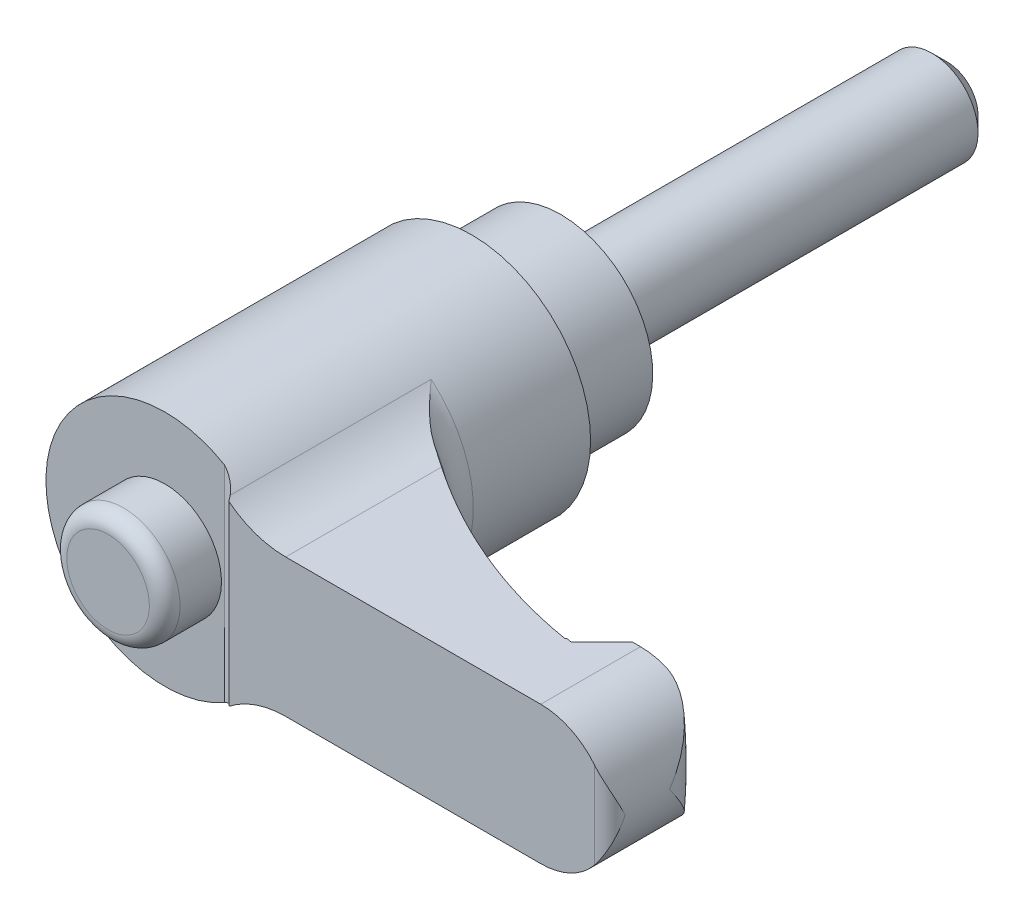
ISO-10303-21;
HEADER;
FILE_DESCRIPTION(('STEP AP214'),'2;1');
FILE_NAME('part.step','',(''),(''),'','','');
FILE_SCHEMA(('AUTOMOTIVE_DESIGN { 1 0 10303 214 1 1 1 1 }'));
ENDSEC;
DATA;
#1=APPLICATION_CONTEXT('core data for automotive mechanical design processes');
#2=APPLICATION_PROTOCOL_DEFINITION('international standard','automotive_design',2000,#1);
#3=PRODUCT_CONTEXT('',#1,'mechanical');
#4=PRODUCT('Part','Part','',(#3));
#5=PRODUCT_RELATED_PRODUCT_CATEGORY('part','',(#4));
#6=PRODUCT_DEFINITION_FORMATION('','',#4);
#7=PRODUCT_DEFINITION_CONTEXT('part definition',#1,'design');
#8=PRODUCT_DEFINITION('design','',#6,#7);
#9=PRODUCT_DEFINITION_SHAPE('','',#8);
#10=(LENGTH_UNIT() NAMED_UNIT(*) SI_UNIT(.MILLI.,.METRE.));
#11=(NAMED_UNIT(*) PLANE_ANGLE_UNIT() SI_UNIT($,.RADIAN.));
#12=(NAMED_UNIT(*) SI_UNIT($,.STERADIAN.) SOLID_ANGLE_UNIT());
#13=UNCERTAINTY_MEASURE_WITH_UNIT(LENGTH_MEASURE(1.E-05),#10,'distance_accuracy_value','');
#14=(GEOMETRIC_REPRESENTATION_CONTEXT(3) GLOBAL_UNCERTAINTY_ASSIGNED_CONTEXT((#13)) GLOBAL_UNIT_ASSIGNED_CONTEXT((#10,
#11,#12)) REPRESENTATION_CONTEXT('',''));
#15=CARTESIAN_POINT('',(0.,0.,0.));
#16=DIRECTION('',(0.,0.,1.));
#17=DIRECTION('',(1.,0.,0.));
#18=AXIS2_PLACEMENT_3D('',#15,#16,#17);
#19=CARTESIAN_POINT('',(4.8,0.,0.));
#20=DIRECTION('',(0.,0.,1.));
#21=DIRECTION('',(0.,-1.,0.));
#22=AXIS2_PLACEMENT_3D('',#19,#20,#21);
#23=PLANE('',#22);
#24=CARTESIAN_POINT('',(0.,0.,0.));
#25=DIRECTION('',(0.,0.,-1.));
#26=DIRECTION('',(0.,1.,0.));
#27=AXIS2_PLACEMENT_3D('',#24,#25,#26);
#28=CIRCLE('',#27,3.);
#29=CARTESIAN_POINT('',(0.,3.,0.));
#30=VERTEX_POINT('',#29);
#31=EDGE_CURVE('E493',#30,#30,#28,.T.);
#32=ORIENTED_EDGE('',*,*,#31,.F.);
#33=EDGE_LOOP('',(#32));
#34=FACE_BOUND('',#33,.T.);
#35=CARTESIAN_POINT('',(0.,0.,0.));
#36=DIRECTION('',(0.,0.,-1.));
#37=DIRECTION('',(0.,1.,0.));
#38=AXIS2_PLACEMENT_3D('',#35,#36,#37);
#39=CIRCLE('',#38,4.8);
#40=CARTESIAN_POINT('',(0.,4.8,0.));
#41=VERTEX_POINT('',#40);
#42=EDGE_CURVE('E433',#41,#41,#39,.T.);
#43=ORIENTED_EDGE('',*,*,#42,.T.);
#44=EDGE_LOOP('',(#43));
#45=FACE_BOUND('',#44,.T.);
#46=ADVANCED_FACE('F14',(#34,#45),#23,.F.);
#47=CARTESIAN_POINT('',(0.,0.,26.));
#48=DIRECTION('',(0.,0.,-1.));
#49=DIRECTION('',(0.,1.,0.));
#50=AXIS2_PLACEMENT_3D('',#47,#48,#49);
#51=PLANE('',#50);
#52=CARTESIAN_POINT('',(0.,0.,26.));
#53=DIRECTION('',(0.,0.,-1.));
#54=DIRECTION('',(0.,1.,0.));
#55=AXIS2_PLACEMENT_3D('',#52,#53,#54);
#56=CIRCLE('',#55,7.75);
#57=CARTESIAN_POINT('',(3.875,-6.7116968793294,26.));
#58=VERTEX_POINT('',#57);
#59=CARTESIAN_POINT('',(3.875,6.7116968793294,26.));
#60=VERTEX_POINT('',#59);
#61=EDGE_CURVE('E380',#58,#60,#56,.T.);
#62=ORIENTED_EDGE('',*,*,#61,.F.);
#63=DIRECTION('',(0.,1.,0.));
#64=VECTOR('',#63,1.);
#65=CARTESIAN_POINT('',(3.875,-9.,26.));
#66=LINE('',#65,#64);
#67=EDGE_CURVE('E467',#58,#60,#66,.T.);
#68=ORIENTED_EDGE('',*,*,#67,.T.);
#69=EDGE_LOOP('',(#62,#68));
#70=FACE_BOUND('',#69,.T.);
#71=CARTESIAN_POINT('',(0.,0.,26.));
#72=DIRECTION('',(0.,0.,-1.));
#73=DIRECTION('',(0.,1.,0.));
#74=AXIS2_PLACEMENT_3D('',#71,#72,#73);
#75=CIRCLE('',#74,3.69047619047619);
#76=CARTESIAN_POINT('',(0.,3.69047619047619,26.));
#77=VERTEX_POINT('',#76);
#78=EDGE_CURVE('E188',#77,#77,#75,.F.);
#79=ORIENTED_EDGE('',*,*,#78,.F.);
#80=EDGE_LOOP('',(#79));
#81=FACE_BOUND('',#80,.T.);
#82=ADVANCED_FACE('F163',(#70,#81),#51,.F.);
#83=CARTESIAN_POINT('',(25.5,0.,0.));
#84=DIRECTION('',(0.,0.,1.));
#85=DIRECTION('',(0.,-1.,0.));
#86=AXIS2_PLACEMENT_3D('',#83,#84,#85);
#87=CYLINDRICAL_SURFACE('',#86,4.5);
#88=CARTESIAN_POINT('',(30.,0.,23.1));
#89=CARTESIAN_POINT('',(30.0000000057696,-0.00397224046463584,23.0972162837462));
#90=CARTESIAN_POINT('',(29.9999947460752,-0.00794462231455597,23.0944324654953));
#91=CARTESIAN_POINT('',(29.9991779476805,-0.316207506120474,22.8784039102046));
#92=CARTESIAN_POINT('',(29.967472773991,-0.621260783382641,22.6646232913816));
#93=CARTESIAN_POINT('',(29.8729566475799,-1.07288244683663,22.3499400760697));
#94=CARTESIAN_POINT('',(29.8335087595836,-1.2227001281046,22.2458576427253));
#95=CARTESIAN_POINT('',(29.7386099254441,-1.51933949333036,22.0407893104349));
#96=CARTESIAN_POINT('',(29.6831664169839,-1.6661625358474,21.9398019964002));
#97=CARTESIAN_POINT('',(29.5225221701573,-2.0316181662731,21.690355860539));
#98=CARTESIAN_POINT('',(29.4064726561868,-2.24755940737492,21.5447545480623));
#99=CARTESIAN_POINT('',(29.1349908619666,-2.66429651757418,21.2699985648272));
#100=CARTESIAN_POINT('',(28.9796468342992,-2.86512503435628,21.1408080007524));
#101=CARTESIAN_POINT('',(28.6740094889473,-3.19567948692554,20.9378778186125));
#102=CARTESIAN_POINT('',(28.5328529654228,-3.3303385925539,20.8584463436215));
#103=CARTESIAN_POINT('',(28.2285136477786,-3.58389708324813,20.7186599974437));
#104=CARTESIAN_POINT('',(28.0653563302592,-3.70281438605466,20.6582833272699));
#105=CARTESIAN_POINT('',(27.7569268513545,-3.89637158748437,20.5739705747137));
#106=CARTESIAN_POINT('',(27.6155988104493,-3.97499958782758,20.5449430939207));
#107=CARTESIAN_POINT('',(27.3962983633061,-4.08175109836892,20.516319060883));
#108=CARTESIAN_POINT('',(27.3219652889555,-4.11547521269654,20.5092639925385));
#109=CARTESIAN_POINT('',(27.1713145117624,-4.17892025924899,20.5006475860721));
#110=CARTESIAN_POINT('',(27.0949977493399,-4.20864304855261,20.4990836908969));
#111=CARTESIAN_POINT('',(26.940135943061,-4.26413478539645,20.5019689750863));
#112=CARTESIAN_POINT('',(26.8615759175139,-4.28985895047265,20.5064814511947));
#113=CARTESIAN_POINT('',(26.7037978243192,-4.33677756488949,20.5220962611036));
#114=CARTESIAN_POINT('',(26.624580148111,-4.35797453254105,20.5331949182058));
#115=CARTESIAN_POINT('',(26.4663684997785,-4.39576374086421,20.5623470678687));
#116=CARTESIAN_POINT('',(26.3873744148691,-4.41235899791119,20.5803959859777));
#117=CARTESIAN_POINT('',(26.230581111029,-4.44101436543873,20.6236628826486));
#118=CARTESIAN_POINT('',(26.1527814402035,-4.4530762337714,20.6488780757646));
#119=CARTESIAN_POINT('',(25.9747863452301,-4.47604389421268,20.7158088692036));
#120=CARTESIAN_POINT('',(25.8753706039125,-4.48535121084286,20.7602222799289));
#121=CARTESIAN_POINT('',(25.7308199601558,-4.4943380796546,20.836059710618));
#122=CARTESIAN_POINT('',(25.6833620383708,-4.49650441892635,20.8629005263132));
#123=CARTESIAN_POINT('',(25.5902043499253,-4.4993369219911,20.9195771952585));
#124=CARTESIAN_POINT('',(25.5445050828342,-4.50000266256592,20.9494138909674));
#125=CARTESIAN_POINT('',(25.4998,-4.49999999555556,20.980704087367));
#126=B_SPLINE_CURVE_WITH_KNOTS('',3,(#88,#89,#90,#91,#92,#93,#94,#95,#96,#97,#98,#99,#100,#101,
#102,#103,#104,#105,#106,#107,#108,#109,#110,#111,#112,#113,#114,#115,#116,#117,#118,#119,#120,
#121,#122,#123,#124,#125),.UNSPECIFIED.,.F.,.F.,(4,2,2,2,2,2,2,2,2,2,2,2,2,2,2,2,2,2,4),(0.,
0.0145521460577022,1.12923174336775,1.68863416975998,2.24777690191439,3.0999476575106,
3.95022123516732,4.58000022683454,5.20905610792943,5.69992949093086,5.94545977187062,
6.19087570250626,6.43886797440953,6.68672193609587,6.93441304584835,7.18200801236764,
7.50864895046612,7.67223429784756,7.83586577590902),.UNSPECIFIED.);
#127=CARTESIAN_POINT('',(27.0737254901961,-4.21584962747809,20.5));
#128=VERTEX_POINT('',#127);
#129=CARTESIAN_POINT('',(30.,0.,23.1));
#130=VERTEX_POINT('',#129);
#131=EDGE_CURVE('E133',#128,#130,#126,.F.);
#132=ORIENTED_EDGE('',*,*,#131,.T.);
#133=CARTESIAN_POINT('',(30.,0.,23.1));
#134=CARTESIAN_POINT('',(30.0000000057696,0.00397224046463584,23.0972162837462));
#135=CARTESIAN_POINT('',(29.9999947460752,0.00794462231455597,23.0944324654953));
#136=CARTESIAN_POINT('',(29.9991779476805,0.316207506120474,22.8784039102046));
#137=CARTESIAN_POINT('',(29.967472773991,0.621260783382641,22.6646232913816));
#138=CARTESIAN_POINT('',(29.8729566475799,1.07288244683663,22.3499400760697));
#139=CARTESIAN_POINT('',(29.8335087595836,1.2227001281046,22.2458576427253));
#140=CARTESIAN_POINT('',(29.7386099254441,1.51933949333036,22.0407893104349));
#141=CARTESIAN_POINT('',(29.6831664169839,1.6661625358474,21.9398019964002));
#142=CARTESIAN_POINT('',(29.5225221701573,2.0316181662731,21.690355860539));
#143=CARTESIAN_POINT('',(29.4064726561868,2.24755940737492,21.5447545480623));
#144=CARTESIAN_POINT('',(29.1349908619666,2.66429651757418,21.2699985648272));
#145=CARTESIAN_POINT('',(28.9796468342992,2.86512503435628,21.1408080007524));
#146=CARTESIAN_POINT('',(28.6740094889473,3.19567948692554,20.9378778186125));
#147=CARTESIAN_POINT('',(28.5328529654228,3.3303385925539,20.8584463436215));
#148=CARTESIAN_POINT('',(28.2285136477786,3.58389708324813,20.7186599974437));
#149=CARTESIAN_POINT('',(28.0653563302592,3.70281438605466,20.6582833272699));
#150=CARTESIAN_POINT('',(27.7569268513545,3.89637158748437,20.5739705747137));
#151=CARTESIAN_POINT('',(27.6155988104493,3.97499958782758,20.5449430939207));
#152=CARTESIAN_POINT('',(27.3962983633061,4.08175109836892,20.516319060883));
#153=CARTESIAN_POINT('',(27.3219652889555,4.11547521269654,20.5092639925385));
#154=CARTESIAN_POINT('',(27.1713145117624,4.17892025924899,20.5006475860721));
#155=CARTESIAN_POINT('',(27.0949977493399,4.20864304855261,20.4990836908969));
#156=CARTESIAN_POINT('',(26.940135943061,4.26413478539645,20.5019689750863));
#157=CARTESIAN_POINT('',(26.8615759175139,4.28985895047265,20.5064814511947));
#158=CARTESIAN_POINT('',(26.7037978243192,4.33677756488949,20.5220962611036));
#159=CARTESIAN_POINT('',(26.624580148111,4.35797453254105,20.5331949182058));
#160=CARTESIAN_POINT('',(26.4663684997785,4.39576374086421,20.5623470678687));
#161=CARTESIAN_POINT('',(26.3873744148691,4.41235899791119,20.5803959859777));
#162=CARTESIAN_POINT('',(26.230581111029,4.44101436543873,20.6236628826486));
#163=CARTESIAN_POINT('',(26.1527814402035,4.4530762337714,20.6488780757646));
#164=CARTESIAN_POINT('',(25.9747863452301,4.47604389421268,20.7158088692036));
#165=CARTESIAN_POINT('',(25.8753706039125,4.48535121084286,20.7602222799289));
#166=CARTESIAN_POINT('',(25.7308199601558,4.4943380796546,20.836059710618));
#167=CARTESIAN_POINT('',(25.6833620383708,4.49650441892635,20.8629005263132));
#168=CARTESIAN_POINT('',(25.5902043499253,4.4993369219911,20.9195771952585));
#169=CARTESIAN_POINT('',(25.5445050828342,4.50000266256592,20.9494138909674));
#170=CARTESIAN_POINT('',(25.4998,4.49999999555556,20.980704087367));
#171=B_SPLINE_CURVE_WITH_KNOTS('',3,(#133,#134,#135,#136,#137,#138,#139,#140,#141,#142,#143,
#144,#145,#146,#147,#148,#149,#150,#151,#152,#153,#154,#155,#156,#157,#158,#159,#160,#161,#162,
#163,#164,#165,#166,#167,#168,#169,#170),.UNSPECIFIED.,.F.,.F.,(4,2,2,2,2,2,2,2,2,2,2,2,2,2,2,2,
2,2,4),(0.,0.0145521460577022,1.12923174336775,1.68863416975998,2.24777690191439,
3.0999476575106,3.95022123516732,4.58000022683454,5.20905610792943,5.69992949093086,
5.94545977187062,6.19087570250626,6.43886797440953,6.68672193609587,6.93441304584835,
7.18200801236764,7.50864895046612,7.67223429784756,7.83586577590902),.UNSPECIFIED.);
#172=CARTESIAN_POINT('',(27.0737254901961,4.21584962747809,20.5));
#173=VERTEX_POINT('',#172);
#174=EDGE_CURVE('E130',#130,#173,#171,.T.);
#175=ORIENTED_EDGE('',*,*,#174,.T.);
#176=CARTESIAN_POINT('',(25.5,0.,20.5));
#177=DIRECTION('',(0.,0.,-1.));
#178=DIRECTION('',(0.,1.,0.));
#179=AXIS2_PLACEMENT_3D('',#176,#177,#178);
#180=CIRCLE('',#179,4.5);
#181=CARTESIAN_POINT('',(25.5,4.5,20.5));
#182=VERTEX_POINT('',#181);
#183=EDGE_CURVE('E405',#173,#182,#180,.F.);
#184=ORIENTED_EDGE('',*,*,#183,.T.);
#185=DIRECTION('',(0.,0.,1.));
#186=VECTOR('',#185,1.);
#187=CARTESIAN_POINT('',(25.5,4.5,0.));
#188=LINE('',#187,#186);
#189=CARTESIAN_POINT('',(25.5,4.5,27.));
#190=VERTEX_POINT('',#189);
#191=EDGE_CURVE('E404',#182,#190,#188,.T.);
#192=ORIENTED_EDGE('',*,*,#191,.T.);
#193=CARTESIAN_POINT('',(25.5,0.,27.));
#194=DIRECTION('',(0.,0.,1.));
#195=DIRECTION('',(0.,-1.,0.));
#196=AXIS2_PLACEMENT_3D('',#193,#194,#195);
#197=CIRCLE('',#196,4.5);
#198=CARTESIAN_POINT('',(29.,2.82842712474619,27.));
#199=VERTEX_POINT('',#198);
#200=EDGE_CURVE('E383',#199,#190,#197,.T.);
#201=ORIENTED_EDGE('',*,*,#200,.F.);
#202=CARTESIAN_POINT('',(29.,2.82842712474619,27.));
#203=CARTESIAN_POINT('',(29.0452569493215,2.77244060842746,26.9999705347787));
#204=CARTESIAN_POINT('',(29.08910814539,2.71541373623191,26.9969310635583));
#205=CARTESIAN_POINT('',(29.1737346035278,2.59976408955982,26.9857221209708));
#206=CARTESIAN_POINT('',(29.2145155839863,2.54114457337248,26.9775624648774));
#207=CARTESIAN_POINT('',(29.2926216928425,2.42301598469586,26.9570723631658));
#208=CARTESIAN_POINT('',(29.3299701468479,2.36351669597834,26.9447732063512));
#209=CARTESIAN_POINT('',(29.4015263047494,2.24343051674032,26.9166544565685));
#210=CARTESIAN_POINT('',(29.4357319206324,2.18284293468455,26.9008325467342));
#211=CARTESIAN_POINT('',(29.5205149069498,2.0242761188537,26.8558925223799));
#212=CARTESIAN_POINT('',(29.5686353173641,1.92562477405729,26.8244847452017));
#213=CARTESIAN_POINT('',(29.6569408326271,1.7267576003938,26.7560098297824));
#214=CARTESIAN_POINT('',(29.6971228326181,1.62654117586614,26.7189404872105));
#215=CARTESIAN_POINT('',(29.769924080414,1.42454335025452,26.6403878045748));
#216=CARTESIAN_POINT('',(29.8025090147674,1.32275698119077,26.5988856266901));
#217=CARTESIAN_POINT('',(29.8600923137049,1.1184186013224,26.5127603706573));
#218=CARTESIAN_POINT('',(29.8850925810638,1.0158667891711,26.4681380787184));
#219=CARTESIAN_POINT('',(29.9373931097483,0.763467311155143,26.3559210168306));
#220=CARTESIAN_POINT('',(29.9605764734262,0.613303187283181,26.2871011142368));
#221=CARTESIAN_POINT('',(29.9916507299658,0.312779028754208,26.1474204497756));
#222=CARTESIAN_POINT('',(29.999578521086,0.162420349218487,26.0765650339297));
#223=CARTESIAN_POINT('',(29.9999945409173,0.00809034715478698,26.0038138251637));
#224=CARTESIAN_POINT('',(29.999999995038,0.00404514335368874,26.0019068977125));
#225=CARTESIAN_POINT('',(30.,0.,26.));
#226=B_SPLINE_CURVE_WITH_KNOTS('',3,(#202,#203,#204,#205,#206,#207,#208,#209,#210,#211,#212,
#213,#214,#215,#216,#217,#218,#219,#220,#221,#222,#223,#224,#225),.UNSPECIFIED.,.F.,.F.,(4,2,2,
2,2,2,2,2,2,2,2,4),(0.,0.215782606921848,0.431152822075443,0.644930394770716,0.858848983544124,
1.20082332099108,1.5429311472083,1.88655545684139,2.23009348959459,2.7297347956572,
3.22816610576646,3.2415825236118),.UNSPECIFIED.);
#227=CARTESIAN_POINT('',(30.,0.,26.));
#228=VERTEX_POINT('',#227);
#229=EDGE_CURVE('E174',#228,#199,#226,.F.);
#230=ORIENTED_EDGE('',*,*,#229,.F.);
#231=CARTESIAN_POINT('',(29.,-2.82842712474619,27.));
#232=CARTESIAN_POINT('',(29.0452569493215,-2.77244060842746,26.9999705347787));
#233=CARTESIAN_POINT('',(29.08910814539,-2.71541373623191,26.9969310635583));
#234=CARTESIAN_POINT('',(29.1737346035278,-2.59976408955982,26.9857221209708));
#235=CARTESIAN_POINT('',(29.2145155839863,-2.54114457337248,26.9775624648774));
#236=CARTESIAN_POINT('',(29.2926216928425,-2.42301598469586,26.9570723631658));
#237=CARTESIAN_POINT('',(29.3299701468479,-2.36351669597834,26.9447732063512));
#238=CARTESIAN_POINT('',(29.4015263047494,-2.24343051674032,26.9166544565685));
#239=CARTESIAN_POINT('',(29.4357319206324,-2.18284293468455,26.9008325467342));
#240=CARTESIAN_POINT('',(29.5205149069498,-2.0242761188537,26.8558925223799));
#241=CARTESIAN_POINT('',(29.5686353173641,-1.92562477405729,26.8244847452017));
#242=CARTESIAN_POINT('',(29.6569408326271,-1.7267576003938,26.7560098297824));
#243=CARTESIAN_POINT('',(29.6971228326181,-1.62654117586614,26.7189404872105));
#244=CARTESIAN_POINT('',(29.769924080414,-1.42454335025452,26.6403878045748));
#245=CARTESIAN_POINT('',(29.8025090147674,-1.32275698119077,26.5988856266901));
#246=CARTESIAN_POINT('',(29.8600923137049,-1.1184186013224,26.5127603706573));
#247=CARTESIAN_POINT('',(29.8850925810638,-1.0158667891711,26.4681380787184));
#248=CARTESIAN_POINT('',(29.9373931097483,-0.763467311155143,26.3559210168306));
#249=CARTESIAN_POINT('',(29.9605764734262,-0.613303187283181,26.2871011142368));
#250=CARTESIAN_POINT('',(29.9916507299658,-0.312779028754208,26.1474204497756));
#251=CARTESIAN_POINT('',(29.999578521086,-0.162420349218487,26.0765650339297));
#252=CARTESIAN_POINT('',(29.9999945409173,-0.00809034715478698,26.0038138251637));
#253=CARTESIAN_POINT('',(29.999999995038,-0.00404514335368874,26.0019068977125));
#254=CARTESIAN_POINT('',(30.,0.,26.));
#255=B_SPLINE_CURVE_WITH_KNOTS('',3,(#231,#232,#233,#234,#235,#236,#237,#238,#239,#240,#241,
#242,#243,#244,#245,#246,#247,#248,#249,#250,#251,#252,#253,#254),.UNSPECIFIED.,.F.,.F.,(4,2,2,
2,2,2,2,2,2,2,2,4),(0.,0.215782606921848,0.431152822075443,0.644930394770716,0.858848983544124,
1.20082332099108,1.5429311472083,1.88655545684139,2.23009348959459,2.7297347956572,
3.22816610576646,3.2415825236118),.UNSPECIFIED.);
#256=CARTESIAN_POINT('',(29.,-2.82842712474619,27.));
#257=VERTEX_POINT('',#256);
#258=EDGE_CURVE('E182',#257,#228,#255,.T.);
#259=ORIENTED_EDGE('',*,*,#258,.F.);
#260=CARTESIAN_POINT('',(25.5,-4.5,27.));
#261=VERTEX_POINT('',#260);
#262=EDGE_CURVE('E389',#261,#257,#197,.T.);
#263=ORIENTED_EDGE('',*,*,#262,.F.);
#264=DIRECTION('',(0.,0.,1.));
#265=VECTOR('',#264,1.);
#266=CARTESIAN_POINT('',(25.5,-4.5,0.));
#267=LINE('',#266,#265);
#268=CARTESIAN_POINT('',(25.5,-4.5,20.5));
#269=VERTEX_POINT('',#268);
#270=EDGE_CURVE('E409',#269,#261,#267,.T.);
#271=ORIENTED_EDGE('',*,*,#270,.F.);
#272=EDGE_CURVE('E140',#269,#128,#180,.F.);
#273=ORIENTED_EDGE('',*,*,#272,.T.);
#274=EDGE_LOOP('',(#132,#175,#184,#192,#201,#230,#259,#263,#271,#273));
#275=FACE_BOUND('',#274,.T.);
#276=ADVANCED_FACE('F138',(#275),#87,.T.);
#277=CARTESIAN_POINT('',(28.072410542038,-9.,-7.06806810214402));
#278=DIRECTION('',(0.,1.,0.));
#279=DIRECTION('',(-1.,0.,0.));
#280=AXIS2_PLACEMENT_3D('',#277,#278,#279);
#281=CYLINDRICAL_SURFACE('',#280,30.);
#282=CARTESIAN_POINT('',(22.457864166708,5.40076351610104,22.4018635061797));
#283=CARTESIAN_POINT('',(22.5328704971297,5.02783315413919,22.4161416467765));
#284=CARTESIAN_POINT('',(22.6003478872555,4.65331694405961,22.4287120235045));
#285=CARTESIAN_POINT('',(22.7199001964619,3.90172149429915,22.4506465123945));
#286=CARTESIAN_POINT('',(22.7719742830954,3.52464211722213,22.4600104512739));
#287=CARTESIAN_POINT('',(22.860391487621,2.76836181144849,22.4757441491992));
#288=CARTESIAN_POINT('',(22.8967259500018,2.38915983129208,22.4821122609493));
#289=CARTESIAN_POINT('',(22.953399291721,1.62955869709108,22.4919810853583));
#290=CARTESIAN_POINT('',(22.9737386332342,1.24915957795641,22.4954818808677));
#291=CARTESIAN_POINT('',(23.0101209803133,0.119914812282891,22.5017516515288));
#292=CARTESIAN_POINT('',(23.0030278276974,-0.62982701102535,22.5005458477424));
#293=CARTESIAN_POINT('',(22.9265280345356,-2.12549757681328,22.487326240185));
#294=CARTESIAN_POINT('',(22.8571649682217,-2.87142861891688,22.4753199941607));
#295=CARTESIAN_POINT('',(22.717445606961,-3.91200869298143,22.450161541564));
#296=CARTESIAN_POINT('',(22.6723784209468,-4.21035002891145,22.4419679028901));
#297=CARTESIAN_POINT('',(22.5724363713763,-4.80637536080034,22.4235048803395));
#298=CARTESIAN_POINT('',(22.5175283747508,-5.10405358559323,22.4132284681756));
#299=CARTESIAN_POINT('',(22.457864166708,-5.40076351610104,22.4018635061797));
#300=B_SPLINE_CURVE_WITH_KNOTS('',3,(#282,#283,#284,#285,#286,#287,#288,#289,#290,#291,#292,
#293,#294,#295,#296,#297,#298,#299),.UNSPECIFIED.,.F.,.F.,(4,2,2,2,2,2,2,2,4),(0.,
1.14192528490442,2.28391227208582,3.4265264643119,4.56910763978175,6.81558260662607,
9.06048679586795,9.96586555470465,10.8743519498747),.UNSPECIFIED.);
#301=CARTESIAN_POINT('',(23.,0.,22.5));
#302=VERTEX_POINT('',#301);
#303=CARTESIAN_POINT('',(22.6238084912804,-4.5,22.4329951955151));
#304=VERTEX_POINT('',#303);
#305=EDGE_CURVE('E136',#302,#304,#300,.T.);
#306=ORIENTED_EDGE('',*,*,#305,.F.);
#307=DIRECTION('',(0.,1.,0.));
#308=VECTOR('',#307,1.);
#309=CARTESIAN_POINT('',(23.,-9.,22.5));
#310=LINE('',#309,#308);
#311=CARTESIAN_POINT('',(23.,-4.5,22.5));
#312=VERTEX_POINT('',#311);
#313=EDGE_CURVE('E473',#312,#302,#310,.T.);
#314=ORIENTED_EDGE('',*,*,#313,.F.);
#315=CARTESIAN_POINT('',(28.072410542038,-4.5,-7.06806810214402));
#316=DIRECTION('',(0.,1.,0.));
#317=DIRECTION('',(-1.,0.,0.));
#318=AXIS2_PLACEMENT_3D('',#315,#316,#317);
#319=CIRCLE('',#318,30.);
#320=EDGE_CURVE('E464',#312,#304,#319,.F.);
#321=ORIENTED_EDGE('',*,*,#320,.T.);
#322=EDGE_LOOP('',(#306,#314,#321));
#323=FACE_BOUND('',#322,.T.);
#324=ADVANCED_FACE('F162',(#323),#281,.F.);
#325=CARTESIAN_POINT('',(27.4,-9.,20.5));
#326=DIRECTION('',(0.,0.,-1.));
#327=DIRECTION('',(0.,1.,0.));
#328=AXIS2_PLACEMENT_3D('',#325,#326,#327);
#329=PLANE('',#328);
#330=ORIENTED_EDGE('',*,*,#183,.F.);
#331=CARTESIAN_POINT('',(0.,0.,20.5));
#332=DIRECTION('',(0.,0.,-1.));
#333=DIRECTION('',(0.,1.,0.));
#334=AXIS2_PLACEMENT_3D('',#331,#332,#333);
#335=CIRCLE('',#334,27.4);
#336=EDGE_CURVE('E37',#173,#128,#335,.T.);
#337=ORIENTED_EDGE('',*,*,#336,.T.);
#338=ORIENTED_EDGE('',*,*,#272,.F.);
#339=DIRECTION('',(-1.,0.,0.));
#340=VECTOR('',#339,1.);
#341=CARTESIAN_POINT('',(25.5,-4.5,20.5));
#342=LINE('',#341,#340);
#343=CARTESIAN_POINT('',(25.,-4.5,20.5));
#344=VERTEX_POINT('',#343);
#345=EDGE_CURVE('E540',#269,#344,#342,.T.);
#346=ORIENTED_EDGE('',*,*,#345,.T.);
#347=DIRECTION('',(0.,1.,0.));
#348=VECTOR('',#347,1.);
#349=CARTESIAN_POINT('',(25.,-9.,20.5));
#350=LINE('',#349,#348);
#351=CARTESIAN_POINT('',(25.,4.5,20.5));
#352=VERTEX_POINT('',#351);
#353=EDGE_CURVE('E460',#344,#352,#350,.T.);
#354=ORIENTED_EDGE('',*,*,#353,.T.);
#355=DIRECTION('',(1.,0.,0.));
#356=VECTOR('',#355,1.);
#357=CARTESIAN_POINT('',(8.87764045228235,4.5,20.5));
#358=LINE('',#357,#356);
#359=EDGE_CURVE('E419',#352,#182,#358,.T.);
#360=ORIENTED_EDGE('',*,*,#359,.T.);
#361=EDGE_LOOP('',(#330,#337,#338,#346,#354,#360));
#362=FACE_BOUND('',#361,.T.);
#363=ADVANCED_FACE('F196',(#362),#329,.T.);
#364=CARTESIAN_POINT('',(0.,0.,27.));
#365=DIRECTION('',(0.,0.,1.));
#366=DIRECTION('',(0.,-1.,0.));
#367=AXIS2_PLACEMENT_3D('',#364,#365,#366);
#368=PLANE('',#367);
#369=CARTESIAN_POINT('',(8.87764045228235,10.5,27.));
#370=DIRECTION('',(0.,0.,1.));
#371=DIRECTION('',(1.,0.,0.));
#372=AXIS2_PLACEMENT_3D('',#369,#370,#371);
#373=CIRCLE('',#372,6.);
#374=CARTESIAN_POINT('',(5.16666666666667,5.78527057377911,27.));
#375=VERTEX_POINT('',#374);
#376=CARTESIAN_POINT('',(8.87764045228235,4.5,27.));
#377=VERTEX_POINT('',#376);
#378=EDGE_CURVE('E414',#375,#377,#373,.T.);
#379=ORIENTED_EDGE('',*,*,#378,.F.);
#380=DIRECTION('',(0.,1.,0.));
#381=VECTOR('',#380,1.);
#382=CARTESIAN_POINT('',(5.16666666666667,-9.,27.));
#383=LINE('',#382,#381);
#384=CARTESIAN_POINT('',(5.16666666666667,-5.78527057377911,27.));
#385=VERTEX_POINT('',#384);
#386=EDGE_CURVE('E453',#385,#375,#383,.T.);
#387=ORIENTED_EDGE('',*,*,#386,.F.);
#388=CARTESIAN_POINT('',(8.87764045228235,-10.5,27.));
#389=DIRECTION('',(0.,0.,1.));
#390=DIRECTION('',(1.,0.,0.));
#391=AXIS2_PLACEMENT_3D('',#388,#389,#390);
#392=CIRCLE('',#391,6.);
#393=CARTESIAN_POINT('',(8.87764045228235,-4.5,27.));
#394=VERTEX_POINT('',#393);
#395=EDGE_CURVE('E417',#394,#385,#392,.T.);
#396=ORIENTED_EDGE('',*,*,#395,.F.);
#397=DIRECTION('',(-1.,0.,0.));
#398=VECTOR('',#397,1.);
#399=CARTESIAN_POINT('',(25.5,-4.5,27.));
#400=LINE('',#399,#398);
#401=EDGE_CURVE('E413',#261,#394,#400,.T.);
#402=ORIENTED_EDGE('',*,*,#401,.F.);
#403=ORIENTED_EDGE('',*,*,#262,.T.);
#404=DIRECTION('',(0.,1.,0.));
#405=VECTOR('',#404,1.);
#406=CARTESIAN_POINT('',(29.,-9.,27.));
#407=LINE('',#406,#405);
#408=EDGE_CURVE('E401',#257,#199,#407,.T.);
#409=ORIENTED_EDGE('',*,*,#408,.T.);
#410=ORIENTED_EDGE('',*,*,#200,.T.);
#411=DIRECTION('',(1.,0.,0.));
#412=VECTOR('',#411,1.);
#413=CARTESIAN_POINT('',(8.87764045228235,4.5,27.));
#414=LINE('',#413,#412);
#415=EDGE_CURVE('E400',#377,#190,#414,.T.);
#416=ORIENTED_EDGE('',*,*,#415,.F.);
#417=EDGE_LOOP('',(#379,#387,#396,#402,#403,#409,#410,#416));
#418=FACE_BOUND('',#417,.T.);
#419=ADVANCED_FACE('F244',(#418),#368,.T.);
#420=CARTESIAN_POINT('',(0.,0.,0.));
#421=DIRECTION('',(0.,0.,-1.));
#422=DIRECTION('',(0.,1.,0.));
#423=AXIS2_PLACEMENT_3D('',#420,#421,#422);
#424=CYLINDRICAL_SURFACE('',#423,7.75);
#425=CARTESIAN_POINT('',(0.,0.,13.6426560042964));
#426=DIRECTION('',(0.,0.,-1.));
#427=DIRECTION('',(0.,1.,0.));
#428=AXIS2_PLACEMENT_3D('',#425,#426,#427);
#429=CIRCLE('',#428,7.75);
#430=CARTESIAN_POINT('',(5.00376098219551,5.91818181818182,13.6426560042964));
#431=VERTEX_POINT('',#430);
#432=CARTESIAN_POINT('',(5.00376098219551,-5.91818181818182,13.6426560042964));
#433=VERTEX_POINT('',#432);
#434=EDGE_CURVE('E374',#431,#433,#429,.T.);
#435=ORIENTED_EDGE('',*,*,#434,.T.);
#436=DIRECTION('',(0.,0.,1.));
#437=VECTOR('',#436,1.);
#438=CARTESIAN_POINT('',(5.00376098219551,-5.91818181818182,0.));
#439=LINE('',#438,#437);
#440=CARTESIAN_POINT('',(5.00376098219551,-5.91818181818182,26.7442638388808));
#441=VERTEX_POINT('',#440);
#442=EDGE_CURVE('E425',#433,#441,#439,.T.);
#443=ORIENTED_EDGE('',*,*,#442,.T.);
#444=CARTESIAN_POINT('',(3.875,-6.7116968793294,26.));
#445=CARTESIAN_POINT('',(3.9487248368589,-6.66914880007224,26.0179048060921));
#446=CARTESIAN_POINT('',(4.02097408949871,-6.62579988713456,26.039874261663));
#447=CARTESIAN_POINT('',(4.16199829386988,-6.53812669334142,26.0915573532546));
#448=CARTESIAN_POINT('',(4.23077434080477,-6.49380272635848,26.1212685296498));
#449=CARTESIAN_POINT('',(4.36202505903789,-6.40634475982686,26.1868862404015));
#450=CARTESIAN_POINT('',(4.42463632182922,-6.36322379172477,26.2225378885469));
#451=CARTESIAN_POINT('',(4.54579687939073,-6.27724013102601,26.3004737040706));
#452=CARTESIAN_POINT('',(4.60434578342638,-6.23437746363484,26.3427585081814));
#453=CARTESIAN_POINT('',(4.71026264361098,-6.1546555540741,26.4283893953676));
#454=CARTESIAN_POINT('',(4.75813291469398,-6.11768751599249,26.4710140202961));
#455=CARTESIAN_POINT('',(4.8500303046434,-6.04509175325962,26.56120031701));
#456=CARTESIAN_POINT('',(4.89405965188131,-6.00946325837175,26.6087590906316));
#457=CARTESIAN_POINT('',(4.97925799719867,-5.9390764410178,26.7103994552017));
#458=CARTESIAN_POINT('',(5.02029084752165,-5.90438218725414,26.7646407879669));
#459=CARTESIAN_POINT('',(5.09738332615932,-5.83796295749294,26.8783962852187));
#460=CARTESIAN_POINT('',(5.13343386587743,-5.80624344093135,26.9379197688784));
#461=CARTESIAN_POINT('',(5.16666666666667,-5.77650894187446,27.));
#462=B_SPLINE_CURVE_WITH_KNOTS('',3,(#444,#445,#446,#447,#448,#449,#450,#451,#452,#453,#454,
#455,#456,#457,#458,#459,#460,#461),.UNSPECIFIED.,.F.,.F.,(4,2,2,2,2,2,2,2,4),(0.,
0.260811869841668,0.521540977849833,0.773092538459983,1.02466826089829,1.24638864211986,
1.4679795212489,1.69664297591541,1.92571819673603),.UNSPECIFIED.);
#463=EDGE_CURVE('E218',#58,#441,#462,.T.);
#464=ORIENTED_EDGE('',*,*,#463,.F.);
#465=ORIENTED_EDGE('',*,*,#61,.T.);
#466=CARTESIAN_POINT('',(5.16666666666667,5.77650894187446,27.));
#467=CARTESIAN_POINT('',(5.13714077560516,5.80292379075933,26.9448365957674));
#468=CARTESIAN_POINT('',(5.1053831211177,5.83091583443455,26.8916890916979));
#469=CARTESIAN_POINT('',(5.03785941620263,5.88934998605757,26.7895453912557));
#470=CARTESIAN_POINT('',(5.00209830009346,5.91978906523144,26.7405442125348));
#471=CARTESIAN_POINT('',(4.92700880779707,5.98243056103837,26.646752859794));
#472=CARTESIAN_POINT('',(4.88768622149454,6.01463008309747,26.6019560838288));
#473=CARTESIAN_POINT('',(4.80573825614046,6.08030777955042,26.5165060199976));
#474=CARTESIAN_POINT('',(4.76311181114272,6.11378636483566,26.4758540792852));
#475=CARTESIAN_POINT('',(4.63114473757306,6.21507952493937,26.3605779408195));
#476=CARTESIAN_POINT('',(4.53728284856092,6.28411879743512,26.2920994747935));
#477=CARTESIAN_POINT('',(4.3393749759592,6.42237347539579,26.1724069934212));
#478=CARTESIAN_POINT('',(4.23533663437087,6.49158871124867,26.1211801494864));
#479=CARTESIAN_POINT('',(4.08621326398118,6.5854168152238,26.0632790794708));
#480=CARTESIAN_POINT('',(4.04469277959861,6.61100425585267,26.0487072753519));
#481=CARTESIAN_POINT('',(3.96061680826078,6.66171281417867,26.0222973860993));
#482=CARTESIAN_POINT('',(3.91806319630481,6.68683464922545,26.0104547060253));
#483=CARTESIAN_POINT('',(3.8750000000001,6.7116968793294,26.));
#484=B_SPLINE_CURVE_WITH_KNOTS('',3,(#466,#467,#468,#469,#470,#471,#472,#473,#474,#475,#476,
#477,#478,#479,#480,#481,#482,#483),.UNSPECIFIED.,.F.,.F.,(4,2,2,2,2,2,2,2,4),(0.,
0.203583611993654,0.406919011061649,0.609929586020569,0.813005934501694,1.21684507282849,
1.62038324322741,1.77301957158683,1.9253970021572),.UNSPECIFIED.);
#485=CARTESIAN_POINT('',(5.0037609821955,5.91818181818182,26.7442638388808));
#486=VERTEX_POINT('',#485);
#487=EDGE_CURVE('E232',#486,#60,#484,.T.);
#488=ORIENTED_EDGE('',*,*,#487,.F.);
#489=DIRECTION('',(0.,0.,1.));
#490=VECTOR('',#489,1.);
#491=CARTESIAN_POINT('',(5.00376098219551,5.91818181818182,0.));
#492=LINE('',#491,#490);
#493=EDGE_CURVE('E431',#431,#486,#492,.T.);
#494=ORIENTED_EDGE('',*,*,#493,.F.);
#495=EDGE_LOOP('',(#435,#443,#464,#465,#488,#494));
#496=FACE_BOUND('',#495,.T.);
#497=CARTESIAN_POINT('',(0.,0.,6.));
#498=DIRECTION('',(0.,0.,-1.));
#499=DIRECTION('',(0.,1.,0.));
#500=AXIS2_PLACEMENT_3D('',#497,#498,#499);
#501=CIRCLE('',#500,7.75);
#502=CARTESIAN_POINT('',(0.,7.75,6.));
#503=VERTEX_POINT('',#502);
#504=EDGE_CURVE('E378',#503,#503,#501,.T.);
#505=ORIENTED_EDGE('',*,*,#504,.F.);
#506=EDGE_LOOP('',(#505));
#507=FACE_BOUND('',#506,.T.);
#508=ADVANCED_FACE('F242',(#496,#507),#424,.T.);
#509=CARTESIAN_POINT('',(8.87764045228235,10.5,0.));
#510=DIRECTION('',(0.,0.,1.));
#511=DIRECTION('',(0.,-1.,0.));
#512=AXIS2_PLACEMENT_3D('',#509,#510,#511);
#513=CYLINDRICAL_SURFACE('',#512,6.);
#514=DIRECTION('',(0.,0.,1.));
#515=VECTOR('',#514,1.);
#516=CARTESIAN_POINT('',(8.87764045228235,4.5,0.));
#517=LINE('',#516,#515);
#518=CARTESIAN_POINT('',(8.87764045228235,4.5,16.8419191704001));
#519=VERTEX_POINT('',#518);
#520=EDGE_CURVE('E408',#519,#377,#517,.T.);
#521=ORIENTED_EDGE('',*,*,#520,.F.);
#522=CARTESIAN_POINT('',(8.87784045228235,4.50000000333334,16.8420543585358));
#523=CARTESIAN_POINT('',(8.76298675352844,4.50000678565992,16.7644412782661));
#524=CARTESIAN_POINT('',(8.64795886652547,4.50329006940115,16.687069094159));
#525=CARTESIAN_POINT('',(8.41786670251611,4.51653249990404,16.5336144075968));
#526=CARTESIAN_POINT('',(8.30280331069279,4.52647413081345,16.457529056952));
#527=CARTESIAN_POINT('',(8.07233993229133,4.55315590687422,16.3070362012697));
#528=CARTESIAN_POINT('',(7.95693991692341,4.56989665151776,16.2326288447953));
#529=CARTESIAN_POINT('',(7.72548993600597,4.61048878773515,16.0861329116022));
#530=CARTESIAN_POINT('',(7.60943905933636,4.63435875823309,16.0140509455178));
#531=CARTESIAN_POINT('',(7.49320434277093,4.66190641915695,15.9436475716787));
#532=B_SPLINE_CURVE_WITH_KNOTS('',3,(#522,#523,#524,#525,#526,#527,#528,#529,#530,#531),
.UNSPECIFIED.,.F.,.F.,(4,2,2,2,4),(0.,0.415830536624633,0.830571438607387,1.24534891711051,
1.66121688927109),.UNSPECIFIED.);
#533=CARTESIAN_POINT('',(7.49353468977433,4.66182809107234,15.9438475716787));
#534=VERTEX_POINT('',#533);
#535=EDGE_CURVE('E258',#519,#534,#532,.T.);
#536=ORIENTED_EDGE('',*,*,#535,.T.);
#537=CARTESIAN_POINT('',(7.49386505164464,4.66174977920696,15.9440475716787));
#538=CARTESIAN_POINT('',(7.41534599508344,4.68036361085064,15.8965108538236));
#539=CARTESIAN_POINT('',(7.33813459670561,4.70033346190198,15.8474028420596));
#540=CARTESIAN_POINT('',(7.18628313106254,4.74278447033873,15.7464454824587));
#541=CARTESIAN_POINT('',(7.11164195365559,4.76526452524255,15.694597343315));
#542=CARTESIAN_POINT('',(6.89171782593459,4.83609524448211,15.5357042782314));
#543=CARTESIAN_POINT('',(6.75010221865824,4.88791699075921,15.4251060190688));
#544=CARTESIAN_POINT('',(6.47674906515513,4.99932791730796,15.1976148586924));
#545=CARTESIAN_POINT('',(6.34496293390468,5.05887426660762,15.0807586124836));
#546=CARTESIAN_POINT('',(6.08952700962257,5.18523508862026,14.8421034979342));
#547=CARTESIAN_POINT('',(5.96588083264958,5.25205275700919,14.7203024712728));
#548=CARTESIAN_POINT('',(5.6959472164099,5.41010140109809,14.4425118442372));
#549=CARTESIAN_POINT('',(5.55174299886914,5.50325599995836,14.2855983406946));
#550=CARTESIAN_POINT('',(5.27355500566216,5.70004368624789,13.9693256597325));
#551=CARTESIAN_POINT('',(5.13957057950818,5.80367610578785,13.8099666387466));
#552=CARTESIAN_POINT('',(5.00807252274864,5.91453907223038,13.6479722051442));
#553=CARTESIAN_POINT('',(5.00591610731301,5.91635969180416,13.6453140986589));
#554=CARTESIAN_POINT('',(5.00376098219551,5.91818181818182,13.6426560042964));
#555=B_SPLINE_CURVE_WITH_KNOTS('',3,(#537,#538,#539,#540,#541,#542,#543,#544,#545,#546,#547,
#548,#549,#550,#551,#552,#553,#554),.UNSPECIFIED.,.F.,.F.,(4,2,2,2,2,2,2,2,4),(0.,
0.280888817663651,0.561654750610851,1.12199628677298,1.67935400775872,2.2369576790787,
2.93418472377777,3.63136735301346,3.6429980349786),.UNSPECIFIED.);
#556=EDGE_CURVE('E249',#534,#431,#555,.T.);
#557=ORIENTED_EDGE('',*,*,#556,.T.);
#558=ORIENTED_EDGE('',*,*,#493,.T.);
#559=CARTESIAN_POINT('',(5.16666666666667,5.78527057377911,27.));
#560=CARTESIAN_POINT('',(5.1544362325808,5.79489712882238,26.9771411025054));
#561=CARTESIAN_POINT('',(5.14182657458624,5.80489933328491,26.9546446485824));
#562=CARTESIAN_POINT('',(5.11593353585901,5.82561925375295,26.910451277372));
#563=CARTESIAN_POINT('',(5.10265156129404,5.83633549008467,26.8887528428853));
#564=CARTESIAN_POINT('',(5.07544919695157,5.85848632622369,26.8461383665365));
#565=CARTESIAN_POINT('',(5.06152881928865,5.86992091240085,26.8252223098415));
#566=CARTESIAN_POINT('',(5.03308032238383,5.89351543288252,26.784152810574));
#567=CARTESIAN_POINT('',(5.0185510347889,5.90567678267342,26.7640009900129));
#568=CARTESIAN_POINT('',(5.0037609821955,5.91818181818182,26.7442638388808));
#569=B_SPLINE_CURVE_WITH_KNOTS('',3,(#559,#560,#561,#562,#563,#564,#565,#566,#567,#568),
.UNSPECIFIED.,.F.,.F.,(4,2,2,2,4),(0.,0.0829550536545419,0.165743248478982,0.248529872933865,
0.331483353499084),.UNSPECIFIED.);
#570=EDGE_CURVE('E226',#375,#486,#569,.T.);
#571=ORIENTED_EDGE('',*,*,#570,.F.);
#572=ORIENTED_EDGE('',*,*,#378,.T.);
#573=EDGE_LOOP('',(#521,#536,#557,#558,#571,#572));
#574=FACE_BOUND('',#573,.T.);
#575=ADVANCED_FACE('F238',(#574),#513,.F.);
#576=CARTESIAN_POINT('',(8.87764045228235,4.5,0.));
#577=DIRECTION('',(0.,-1.,0.));
#578=DIRECTION('',(1.,0.,0.));
#579=AXIS2_PLACEMENT_3D('',#576,#577,#578);
#580=PLANE('',#579);
#581=CARTESIAN_POINT('',(28.072410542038,4.5,-7.06806810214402));
#582=DIRECTION('',(0.,-1.,0.));
#583=DIRECTION('',(1.,0.,0.));
#584=AXIS2_PLACEMENT_3D('',#581,#582,#583);
#585=CIRCLE('',#584,30.);
#586=CARTESIAN_POINT('',(22.6238084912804,4.5,22.432995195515));
#587=VERTEX_POINT('',#586);
#588=CARTESIAN_POINT('',(23.,4.5,22.5));
#589=VERTEX_POINT('',#588);
#590=EDGE_CURVE('E461',#587,#589,#585,.F.);
#591=ORIENTED_EDGE('',*,*,#590,.F.);
#592=CARTESIAN_POINT('',(44.3300735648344,4.5,0.942111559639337));
#593=CARTESIAN_POINT('',(43.4547012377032,4.5,1.81300466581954));
#594=CARTESIAN_POINT('',(42.5792011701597,4.5,2.68376940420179));
#595=CARTESIAN_POINT('',(40.8278840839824,4.5,4.42498033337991));
#596=CARTESIAN_POINT('',(39.9520670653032,4.5,5.29542652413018));
#597=CARTESIAN_POINT('',(37.3240501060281,4.5,7.90619283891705));
#598=CARTESIAN_POINT('',(35.5712829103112,4.5,9.64594205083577));
#599=CARTESIAN_POINT('',(32.0635642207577,4.5,13.1230346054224));
#600=CARTESIAN_POINT('',(30.3086128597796,4.5,14.8603780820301));
#601=CARTESIAN_POINT('',(27.6733297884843,4.5,17.4635089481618));
#602=CARTESIAN_POINT('',(26.7944244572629,4.5,18.3307401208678));
#603=CARTESIAN_POINT('',(25.0353323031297,4.5,20.0639019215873));
#604=CARTESIAN_POINT('',(24.155145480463,4.5,20.9298325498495));
#605=CARTESIAN_POINT('',(22.3129521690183,4.5,22.7385304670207));
#606=CARTESIAN_POINT('',(21.3507796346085,4.5,23.6811286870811));
#607=CARTESIAN_POINT('',(19.4234130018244,4.5,25.5632155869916));
#608=CARTESIAN_POINT('',(18.4582189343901,4.5,26.5027042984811));
#609=CARTESIAN_POINT('',(17.0068469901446,4.5,27.9082821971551));
#610=CARTESIAN_POINT('',(16.5224491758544,4.5,28.3762088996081));
#611=CARTESIAN_POINT('',(15.5521170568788,4.5,29.3104634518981));
#612=CARTESIAN_POINT('',(15.0661827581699,4.5,29.7767913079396));
#613=CARTESIAN_POINT('',(14.0922926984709,4.5,30.7073654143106));
#614=CARTESIAN_POINT('',(13.6043368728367,4.5,31.1716115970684));
#615=CARTESIAN_POINT('',(12.8703741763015,4.5,31.8658425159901));
#616=CARTESIAN_POINT('',(12.625380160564,4.5,32.0968979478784));
#617=CARTESIAN_POINT('',(12.1345901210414,4.5,32.5581570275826));
#618=CARTESIAN_POINT('',(11.8887940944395,4.5,32.7883606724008));
#619=CARTESIAN_POINT('',(11.6425345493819,4.5,33.0180686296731));
#620=B_SPLINE_CURVE_WITH_KNOTS('',3,(#592,#593,#594,#595,#596,#597,#598,#599,#600,#601,#602,
#603,#604,#605,#606,#607,#608,#609,#610,#611,#612,#613,#614,#615,#616,#617,#618,#619),
.UNSPECIFIED.,.F.,.F.,(4,2,2,2,2,2,2,2,2,2,2,2,2,4),(0.,3.70440058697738,7.40880170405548,
14.8175982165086,22.225964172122,25.9301609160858,29.6343569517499,33.6751954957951,
37.7159927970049,39.736477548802,41.7569544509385,43.7774964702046,44.7877808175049,
45.7980687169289),.UNSPECIFIED.);
#621=CARTESIAN_POINT('',(22.55548713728,4.5,22.5));
#622=VERTEX_POINT('',#621);
#623=EDGE_CURVE('E304',#587,#622,#620,.T.);
#624=ORIENTED_EDGE('',*,*,#623,.T.);
#625=CARTESIAN_POINT('',(15.4388208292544,4.5,20.4312501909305));
#626=CARTESIAN_POINT('',(14.9382009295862,4.5,20.2216724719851));
#627=CARTESIAN_POINT('',(14.4426076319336,4.5,19.9999912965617));
#628=CARTESIAN_POINT('',(13.4622769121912,4.5,19.5336725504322));
#629=CARTESIAN_POINT('',(12.9775414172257,4.5,19.2890309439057));
#630=CARTESIAN_POINT('',(12.0194633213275,4.5,18.778303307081));
#631=CARTESIAN_POINT('',(11.5461217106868,4.5,18.5122154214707));
#632=CARTESIAN_POINT('',(10.6110367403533,4.5,17.9604954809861));
#633=CARTESIAN_POINT('',(10.1492927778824,4.5,17.6748644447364));
#634=CARTESIAN_POINT('',(9.23133715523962,4.5,17.0827723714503));
#635=CARTESIAN_POINT('',(8.77526312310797,4.5,16.776098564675));
#636=CARTESIAN_POINT('',(8.09865121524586,4.5,16.3053789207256));
#637=CARTESIAN_POINT('',(7.87435773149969,4.5,16.1466830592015));
#638=CARTESIAN_POINT('',(7.42793360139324,4.5,15.826278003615));
#639=CARTESIAN_POINT('',(7.20580294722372,4.5,15.6645688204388));
#640=CARTESIAN_POINT('',(6.76333109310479,4.5,15.3388557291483));
#641=CARTESIAN_POINT('',(6.54298941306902,4.5,15.1748524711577));
#642=CARTESIAN_POINT('',(6.10341304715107,4.5,14.8453678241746));
#643=CARTESIAN_POINT('',(5.88417837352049,4.5,14.6798864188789));
#644=CARTESIAN_POINT('',(5.44597621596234,4.5,14.3486019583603));
#645=CARTESIAN_POINT('',(5.22700871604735,4.5,14.1827989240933));
#646=CARTESIAN_POINT('',(4.7881475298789,4.5,13.8524268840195));
#647=CARTESIAN_POINT('',(4.56825387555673,4.5,13.6878578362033));
#648=CARTESIAN_POINT('',(4.22599707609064,4.5,13.4359606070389));
#649=CARTESIAN_POINT('',(4.10454867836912,4.5,13.3473935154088));
#650=CARTESIAN_POINT('',(3.86050375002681,4.5,13.1718439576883));
#651=CARTESIAN_POINT('',(3.73790719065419,4.5,13.0848615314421));
#652=CARTESIAN_POINT('',(3.49095051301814,4.5,12.9129975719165));
#653=CARTESIAN_POINT('',(3.36658787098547,4.5,12.8281196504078));
#654=CARTESIAN_POINT('',(3.11579592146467,4.5,12.661467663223));
#655=CARTESIAN_POINT('',(2.98936669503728,4.5,12.5796934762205));
#656=CARTESIAN_POINT('',(2.73559541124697,4.5,12.421447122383));
#657=CARTESIAN_POINT('',(2.60828909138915,4.5,12.3449180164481));
#658=CARTESIAN_POINT('',(2.35045679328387,4.5,12.1973627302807));
#659=CARTESIAN_POINT('',(2.21993005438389,4.5,12.1263378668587));
#660=CARTESIAN_POINT('',(1.95547938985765,4.5,11.9918684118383));
#661=CARTESIAN_POINT('',(1.82156674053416,4.5,11.9284018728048));
#662=CARTESIAN_POINT('',(1.54956725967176,4.5,11.811188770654));
#663=CARTESIAN_POINT('',(1.41148300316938,4.5,11.7574363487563));
#664=CARTESIAN_POINT('',(1.16760292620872,4.5,11.6748301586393));
#665=CARTESIAN_POINT('',(1.06277320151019,4.5,11.6431384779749));
#666=CARTESIAN_POINT('',(0.850970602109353,4.5,11.5877982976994));
#667=CARTESIAN_POINT('',(0.743997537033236,4.5,11.5641505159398));
#668=CARTESIAN_POINT('',(0.528623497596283,4.5,11.5260430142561));
#669=CARTESIAN_POINT('',(0.420225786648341,4.5,11.5115651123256));
#670=CARTESIAN_POINT('',(0.202558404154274,4.5,11.4925018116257));
#671=CARTESIAN_POINT('',(0.0932888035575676,4.5,11.4879156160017));
#672=CARTESIAN_POINT('',(-0.125523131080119,4.5,11.4889012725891));
#673=CARTESIAN_POINT('',(-0.235065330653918,4.5,11.494502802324));
#674=CARTESIAN_POINT('',(-0.453184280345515,4.5,11.5155971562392));
#675=CARTESIAN_POINT('',(-0.561760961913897,4.5,11.5310906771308));
#676=CARTESIAN_POINT('',(-0.777434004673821,4.5,11.5711835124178));
#677=CARTESIAN_POINT('',(-0.884526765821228,4.5,11.5958019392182));
#678=CARTESIAN_POINT('',(-1.09652638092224,4.5,11.653010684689));
#679=CARTESIAN_POINT('',(-1.20143316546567,4.5,11.6856012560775));
#680=CARTESIAN_POINT('',(-1.54299128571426,4.5,11.8040046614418));
#681=CARTESIAN_POINT('',(-1.77469278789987,4.5,11.9041680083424));
#682=CARTESIAN_POINT('',(-2.11370642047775,4.5,12.0712278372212));
#683=CARTESIAN_POINT('',(-2.22542247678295,4.5,12.1298009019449));
#684=CARTESIAN_POINT('',(-2.4464125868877,4.5,12.2514053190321));
#685=CARTESIAN_POINT('',(-2.55568698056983,4.5,12.314436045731));
#686=CARTESIAN_POINT('',(-2.77325410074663,4.5,12.4446206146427));
#687=CARTESIAN_POINT('',(-2.88152520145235,4.5,12.5118101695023));
#688=CARTESIAN_POINT('',(-3.09631836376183,4.5,12.648928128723));
#689=CARTESIAN_POINT('',(-3.20284038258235,4.5,12.7188565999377));
#690=CARTESIAN_POINT('',(-3.41436916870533,4.5,12.8607497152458));
#691=CARTESIAN_POINT('',(-3.51937725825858,4.5,12.9327123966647));
#692=CARTESIAN_POINT('',(-3.72827441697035,4.5,13.0782322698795));
#693=CARTESIAN_POINT('',(-3.83216352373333,4.5,13.1517894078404));
#694=CARTESIAN_POINT('',(-4.05439859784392,4.5,13.3110694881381));
#695=CARTESIAN_POINT('',(-4.17260856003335,4.5,13.3969817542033));
#696=CARTESIAN_POINT('',(-4.4082339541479,4.5,13.5698902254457));
#697=CARTESIAN_POINT('',(-4.52564937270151,4.5,13.6568864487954));
#698=CARTESIAN_POINT('',(-4.87714945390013,4.5,13.9189069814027));
#699=CARTESIAN_POINT('',(-5.11047154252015,4.5,14.094951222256));
#700=CARTESIAN_POINT('',(-5.57685056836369,4.5,14.4474717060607));
#701=CARTESIAN_POINT('',(-5.80990745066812,4.5,14.6239480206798));
#702=CARTESIAN_POINT('',(-6.27690523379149,4.5,14.9757283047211));
#703=CARTESIAN_POINT('',(-6.51084612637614,4.5,15.1510322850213));
#704=CARTESIAN_POINT('',(-6.98047432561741,4.5,15.4993223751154));
#705=CARTESIAN_POINT('',(-7.21616173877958,4.5,15.6723083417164));
#706=CARTESIAN_POINT('',(-7.68986343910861,4.5,16.0150746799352));
#707=CARTESIAN_POINT('',(-7.92787774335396,4.5,16.1848550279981));
#708=CARTESIAN_POINT('',(-8.40663111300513,4.5,16.5205040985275));
#709=CARTESIAN_POINT('',(-8.64736999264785,4.5,16.6863730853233));
#710=CARTESIAN_POINT('',(-9.13186171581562,4.5,17.0136492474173));
#711=CARTESIAN_POINT('',(-9.37561458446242,4.5,17.1750563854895));
#712=CARTESIAN_POINT('',(-10.1060893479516,4.5,17.6482368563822));
#713=CARTESIAN_POINT('',(-10.5975021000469,4.5,17.952835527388));
#714=CARTESIAN_POINT('',(-11.5934664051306,4.5,18.5398125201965));
#715=CARTESIAN_POINT('',(-12.0980184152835,4.5,18.8221900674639));
#716=CARTESIAN_POINT('',(-13.1203636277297,4.5,19.362665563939));
#717=CARTESIAN_POINT('',(-13.6381640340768,4.5,19.6207499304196));
#718=CARTESIAN_POINT('',(-14.6860430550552,4.5,20.11066531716));
#719=CARTESIAN_POINT('',(-15.2161220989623,4.5,20.3424954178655));
#720=CARTESIAN_POINT('',(-16.5720374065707,4.5,20.8941289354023));
#721=CARTESIAN_POINT('',(-17.4055454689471,4.5,21.1953302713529));
#722=CARTESIAN_POINT('',(-19.0940463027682,4.5,21.7283556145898));
#723=CARTESIAN_POINT('',(-19.9490297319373,4.5,21.960209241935));
#724=CARTESIAN_POINT('',(-21.6811099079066,4.5,22.3529309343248));
#725=CARTESIAN_POINT('',(-22.5583149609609,4.5,22.5133231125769));
#726=CARTESIAN_POINT('',(-24.3233745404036,4.5,22.7586307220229));
#727=CARTESIAN_POINT('',(-25.2112306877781,4.5,22.8435345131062));
#728=CARTESIAN_POINT('',(-26.9908314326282,4.5,22.9363918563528));
#729=CARTESIAN_POINT('',(-27.8825753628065,4.5,22.9443581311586));
#730=CARTESIAN_POINT('',(-29.663358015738,4.5,22.8827217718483));
#731=CARTESIAN_POINT('',(-30.5523968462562,4.5,22.8131222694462));
#732=CARTESIAN_POINT('',(-32.31901432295,4.5,22.5966903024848));
#733=CARTESIAN_POINT('',(-33.1966141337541,4.5,22.4500307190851));
#734=CARTESIAN_POINT('',(-34.935590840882,4.5,22.080370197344));
#735=CARTESIAN_POINT('',(-35.796967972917,4.5,21.8573703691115));
#736=CARTESIAN_POINT('',(-37.4685359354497,4.5,21.3451591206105));
#737=CARTESIAN_POINT('',(-38.2794766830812,4.5,21.0583920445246));
#738=CARTESIAN_POINT('',(-39.873960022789,4.5,20.4167921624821));
#739=CARTESIAN_POINT('',(-40.6575033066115,4.5,20.0619610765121));
#740=CARTESIAN_POINT('',(-42.1918635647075,4.5,19.2864593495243));
#741=CARTESIAN_POINT('',(-42.9426616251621,4.5,18.8657512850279));
#742=CARTESIAN_POINT('',(-44.4054978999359,4.5,17.9616153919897));
#743=CARTESIAN_POINT('',(-45.1175362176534,4.5,17.4781877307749));
#744=CARTESIAN_POINT('',(-46.4882343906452,4.5,16.4590216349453));
#745=CARTESIAN_POINT('',(-47.1474852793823,4.5,15.9240778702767));
#746=CARTESIAN_POINT('',(-48.4183395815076,4.5,14.8003122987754));
#747=CARTESIAN_POINT('',(-49.0299435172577,4.5,14.2114910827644));
#748=CARTESIAN_POINT('',(-50.2009517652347,4.5,12.9842748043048));
#749=CARTESIAN_POINT('',(-50.7603665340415,4.5,12.3458897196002));
#750=CARTESIAN_POINT('',(-51.8230723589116,4.5,11.0239977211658));
#751=CARTESIAN_POINT('',(-52.3263634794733,4.5,10.3404908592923));
#752=CARTESIAN_POINT('',(-53.2706922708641,4.5,8.93692421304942));
#753=CARTESIAN_POINT('',(-53.7120407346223,4.5,8.21707350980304));
#754=CARTESIAN_POINT('',(-54.532396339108,4.5,6.74268654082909));
#755=CARTESIAN_POINT('',(-54.9114037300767,4.5,5.98815041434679));
#756=CARTESIAN_POINT('',(-55.6043575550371,4.5,4.44974284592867));
#757=CARTESIAN_POINT('',(-55.9183019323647,4.5,3.66587047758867));
#758=CARTESIAN_POINT('',(-56.478850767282,4.5,2.07440645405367));
#759=CARTESIAN_POINT('',(-56.7254552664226,4.5,1.26681481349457));
#760=CARTESIAN_POINT('',(-57.14904744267,4.5,-0.364399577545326));
#761=CARTESIAN_POINT('',(-57.3261971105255,4.5,-1.18798026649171));
#762=CARTESIAN_POINT('',(-57.6104293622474,4.5,-2.84714412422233));
#763=CARTESIAN_POINT('',(-57.7175120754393,4.5,-3.68272727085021));
#764=CARTESIAN_POINT('',(-57.8608403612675,4.5,-5.35993452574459));
#765=CARTESIAN_POINT('',(-57.8970869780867,4.5,-6.20155854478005));
#766=CARTESIAN_POINT('',(-57.8984858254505,4.5,-7.8848657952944));
#767=CARTESIAN_POINT('',(-57.8636380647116,4.5,-8.72654902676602));
#768=CARTESIAN_POINT('',(-57.7231579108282,4.5,-10.4032722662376));
#769=CARTESIAN_POINT('',(-57.6175852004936,4.5,-11.2383172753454));
#770=CARTESIAN_POINT('',(-57.3364725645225,4.5,-12.8965453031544));
#771=CARTESIAN_POINT('',(-57.1609326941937,4.5,-13.7197283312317));
#772=CARTESIAN_POINT('',(-56.7411440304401,4.5,-15.348385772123));
#773=CARTESIAN_POINT('',(-56.4968951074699,4.5,-16.1538601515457));
#774=CARTESIAN_POINT('',(-55.9414392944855,4.5,-17.7413808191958));
#775=CARTESIAN_POINT('',(-55.6302323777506,4.5,-18.5234270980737));
#776=CARTESIAN_POINT('',(-54.9430163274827,4.5,-20.0587116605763));
#777=CARTESIAN_POINT('',(-54.5669932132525,4.5,-20.8119436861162));
#778=CARTESIAN_POINT('',(-53.7528854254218,4.5,-22.28408588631));
#779=CARTESIAN_POINT('',(-53.3148007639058,4.5,-23.0029960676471));
#780=CARTESIAN_POINT('',(-52.3797121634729,4.5,-24.4014049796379));
#781=CARTESIAN_POINT('',(-51.8827089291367,4.5,-25.0809041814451));
#782=CARTESIAN_POINT('',(-50.8333343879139,4.5,-26.3957112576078));
#783=CARTESIAN_POINT('',(-50.2809630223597,4.5,-27.0310190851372));
#784=CARTESIAN_POINT('',(-49.1240210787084,4.5,-28.2538041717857));
#785=CARTESIAN_POINT('',(-48.519381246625,4.5,-28.841215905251));
#786=CARTESIAN_POINT('',(-47.2628697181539,4.5,-29.9631382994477));
#787=CARTESIAN_POINT('',(-46.6109980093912,4.5,-30.4976489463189));
#788=CARTESIAN_POINT('',(-45.2646445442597,4.5,-31.5100756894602));
#789=CARTESIAN_POINT('',(-44.5701605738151,4.5,-31.9879888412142));
#790=CARTESIAN_POINT('',(-43.1435639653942,4.5,-32.8838941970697));
#791=CARTESIAN_POINT('',(-42.4114512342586,4.5,-33.3018862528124));
#792=CARTESIAN_POINT('',(-40.912331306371,4.5,-34.0763837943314));
#793=CARTESIAN_POINT('',(-40.145216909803,4.5,-34.4326817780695));
#794=CARTESIAN_POINT('',(-38.5838228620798,4.5,-35.0797120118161));
#795=CARTESIAN_POINT('',(-37.7895432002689,4.5,-35.3704442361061));
#796=CARTESIAN_POINT('',(-36.1796169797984,4.5,-35.884414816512));
#797=CARTESIAN_POINT('',(-35.3639746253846,4.5,-36.1076663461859));
#798=CARTESIAN_POINT('',(-33.7169153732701,4.5,-36.485403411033));
#799=CARTESIAN_POINT('',(-32.8854983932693,4.5,-36.6398885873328));
#800=CARTESIAN_POINT('',(-31.2068509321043,4.5,-36.8801373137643));
#801=CARTESIAN_POINT('',(-30.3595503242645,4.5,-36.9654093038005));
#802=CARTESIAN_POINT('',(-28.6606960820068,4.5,-37.0651578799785));
#803=CARTESIAN_POINT('',(-27.8091424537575,4.5,-37.0796345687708));
#804=CARTESIAN_POINT('',(-26.5330536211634,4.5,-37.0485559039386));
#805=CARTESIAN_POINT('',(-26.107715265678,4.5,-37.0293778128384));
#806=CARTESIAN_POINT('',(-25.2581880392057,4.5,-36.9735158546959));
#807=CARTESIAN_POINT('',(-24.8339991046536,4.5,-36.9368329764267));
#808=CARTESIAN_POINT('',(-23.9875137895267,4.5,-36.8461059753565));
#809=CARTESIAN_POINT('',(-23.5652172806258,4.5,-36.7920630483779));
#810=CARTESIAN_POINT('',(-22.7231096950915,4.5,-36.6668007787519));
#811=CARTESIAN_POINT('',(-22.3032991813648,4.5,-36.5955776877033));
#812=CARTESIAN_POINT('',(-21.0326362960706,4.5,-36.3534077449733));
#813=CARTESIAN_POINT('',(-20.1867400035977,4.5,-36.1556925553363));
#814=CARTESIAN_POINT('',(-18.5137717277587,4.5,-35.6923115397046));
#815=CARTESIAN_POINT('',(-17.6867009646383,4.5,-35.4266413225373));
#816=CARTESIAN_POINT('',(-16.4648122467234,4.5,-34.9802120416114));
#817=CARTESIAN_POINT('',(-16.0610185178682,4.5,-34.8235901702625));
#818=CARTESIAN_POINT('',(-15.2598672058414,4.5,-34.494886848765));
#819=CARTESIAN_POINT('',(-14.8625080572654,4.5,-34.3228092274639));
#820=CARTESIAN_POINT('',(-14.0745563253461,4.5,-33.9637665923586));
#821=CARTESIAN_POINT('',(-13.6839641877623,4.5,-33.7768006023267));
#822=CARTESIAN_POINT('',(-12.909871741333,4.5,-33.3886824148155));
#823=CARTESIAN_POINT('',(-12.5263717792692,4.5,-33.1875295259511));
#824=CARTESIAN_POINT('',(-11.8207248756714,4.5,-32.801439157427));
#825=CARTESIAN_POINT('',(-11.4976102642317,4.5,-32.6182650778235));
#826=CARTESIAN_POINT('',(-10.8567820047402,4.5,-32.2426997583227));
#827=CARTESIAN_POINT('',(-10.539068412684,4.5,-32.0503084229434));
#828=CARTESIAN_POINT('',(-9.90902430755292,4.5,-31.6570700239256));
#829=CARTESIAN_POINT('',(-9.59669262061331,4.5,-31.4562248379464));
#830=CARTESIAN_POINT('',(-8.97708038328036,4.5,-31.0468984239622));
#831=CARTESIAN_POINT('',(-8.66979986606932,4.5,-30.838417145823));
#832=CARTESIAN_POINT('',(-8.05909926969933,4.5,-30.414391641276));
#833=CARTESIAN_POINT('',(-7.75568987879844,4.5,-30.1988320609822));
#834=CARTESIAN_POINT('',(-7.15264493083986,4.5,-29.7624945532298));
#835=CARTESIAN_POINT('',(-6.853009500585,4.5,-29.5417164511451));
#836=CARTESIAN_POINT('',(-6.25625428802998,4.5,-29.0968095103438));
#837=CARTESIAN_POINT('',(-5.95913448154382,4.5,-28.8726807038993));
#838=CARTESIAN_POINT('',(-5.51381007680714,4.5,-28.5360257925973));
#839=CARTESIAN_POINT('',(-5.36542874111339,4.5,-28.4237312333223));
#840=CARTESIAN_POINT('',(-5.06841921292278,4.5,-28.199468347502));
#841=CARTESIAN_POINT('',(-4.91979102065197,4.5,-28.0875000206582));
#842=CARTESIAN_POINT('',(-4.6673759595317,4.5,-27.8985569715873));
#843=CARTESIAN_POINT('',(-4.56376685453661,4.5,-27.8213455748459));
#844=CARTESIAN_POINT('',(-4.35603430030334,4.5,-27.6676191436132));
#845=CARTESIAN_POINT('',(-4.25191084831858,4.5,-27.5911041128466));
#846=CARTESIAN_POINT('',(-3.93839628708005,4.5,-27.3629654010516));
#847=CARTESIAN_POINT('',(-3.72792755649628,4.5,-27.2127984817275));
#848=CARTESIAN_POINT('',(-3.40866330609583,4.5,-26.9930527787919));
#849=CARTESIAN_POINT('',(-3.30173041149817,4.5,-26.920774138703));
#850=CARTESIAN_POINT('',(-3.08629576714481,4.5,-26.7785997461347));
#851=CARTESIAN_POINT('',(-2.97779412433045,4.5,-26.7087038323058));
#852=CARTESIAN_POINT('',(-2.75891564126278,4.5,-26.5720402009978));
#853=CARTESIAN_POINT('',(-2.64853991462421,4.5,-26.5052707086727));
#854=CARTESIAN_POINT('',(-2.42546973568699,4.5,-26.3757336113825));
#855=CARTESIAN_POINT('',(-2.31277560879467,4.5,-26.3129654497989));
#856=CARTESIAN_POINT('',(-2.08830306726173,4.5,-26.1944953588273));
#857=CARTESIAN_POINT('',(-1.97661068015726,4.5,-26.1386316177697));
#858=CARTESIAN_POINT('',(-1.75033429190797,4.5,-26.0330124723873));
#859=CARTESIAN_POINT('',(-1.63575004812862,4.5,-25.9832575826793));
#860=CARTESIAN_POINT('',(-1.40370429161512,4.5,-25.8914945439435));
#861=CARTESIAN_POINT('',(-1.28624783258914,4.5,-25.8494737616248));
#862=CARTESIAN_POINT('',(-1.04839229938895,4.5,-25.7748468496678));
#863=CARTESIAN_POINT('',(-0.927994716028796,4.5,-25.7422360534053));
#864=CARTESIAN_POINT('',(-0.704765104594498,4.5,-25.6926144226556));
#865=CARTESIAN_POINT('',(-0.602309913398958,4.5,-25.6739180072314));
#866=CARTESIAN_POINT('',(-0.396192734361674,4.5,-25.6451371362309));
#867=CARTESIAN_POINT('',(-0.292530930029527,4.5,-25.6350513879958));
#868=CARTESIAN_POINT('',(-0.0849035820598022,4.5,-25.6240115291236));
#869=CARTESIAN_POINT('',(0.0190610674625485,4.5,-25.6230408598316));
#870=CARTESIAN_POINT('',(0.226677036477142,4.5,-25.6302356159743));
#871=CARTESIAN_POINT('',(0.330328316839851,4.5,-25.6384021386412));
#872=CARTESIAN_POINT('',(0.558826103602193,4.5,-25.6661714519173));
#873=CARTESIAN_POINT('',(0.683419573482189,4.5,-25.687861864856));
#874=CARTESIAN_POINT('',(0.930070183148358,4.5,-25.7427051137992));
#875=CARTESIAN_POINT('',(1.05212589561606,4.5,-25.7758642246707));
#876=CARTESIAN_POINT('',(1.29373096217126,4.5,-25.8519835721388));
#877=CARTESIAN_POINT('',(1.41326576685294,4.5,-25.8949893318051));
#878=CARTESIAN_POINT('',(1.64912618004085,4.5,-25.9888630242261));
#879=CARTESIAN_POINT('',(1.76545261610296,4.5,-26.0397289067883));
#880=CARTESIAN_POINT('',(2.08022955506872,4.5,-26.1876658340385));
#881=CARTESIAN_POINT('',(2.27569357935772,4.5,-26.291055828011));
#882=CARTESIAN_POINT('',(2.65965824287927,4.5,-26.510129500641));
#883=CARTESIAN_POINT('',(2.84815185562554,4.5,-26.6258251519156));
#884=CARTESIAN_POINT('',(3.2206264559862,4.5,-26.865464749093));
#885=CARTESIAN_POINT('',(3.40459103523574,4.5,-26.9894339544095));
#886=CARTESIAN_POINT('',(3.76897708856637,4.5,-27.2422768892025));
#887=CARTESIAN_POINT('',(3.94939990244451,4.5,-27.3711487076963));
#888=CARTESIAN_POINT('',(4.30959038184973,4.5,-27.6329175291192));
#889=CARTESIAN_POINT('',(4.48934008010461,4.5,-27.7658391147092));
#890=CARTESIAN_POINT('',(4.84769993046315,4.5,-28.0332268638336));
#891=CARTESIAN_POINT('',(5.02631000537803,4.5,-28.1676931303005));
#892=CARTESIAN_POINT('',(5.38285547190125,4.5,-28.4368710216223));
#893=CARTESIAN_POINT('',(5.56079149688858,4.5,-28.5715818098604));
#894=CARTESIAN_POINT('',(5.91689994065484,4.5,-28.8406969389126));
#895=CARTESIAN_POINT('',(6.09507236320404,4.5,-28.9751012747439));
#896=CARTESIAN_POINT('',(6.51845290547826,4.5,-29.2927601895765));
#897=CARTESIAN_POINT('',(6.76396770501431,4.5,-29.4756076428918));
#898=CARTESIAN_POINT('',(7.25717026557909,4.5,-29.8383539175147));
#899=CARTESIAN_POINT('',(7.50485801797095,4.5,-30.0182527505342));
#900=CARTESIAN_POINT('',(8.00299141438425,4.5,-30.374186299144));
#901=CARTESIAN_POINT('',(8.25343697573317,4.5,-30.550221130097));
#902=CARTESIAN_POINT('',(8.75748514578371,4.5,-30.8977104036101));
#903=CARTESIAN_POINT('',(9.01108777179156,4.5,-31.0691648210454));
#904=CARTESIAN_POINT('',(9.77721510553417,4.5,-31.5758563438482));
#905=CARTESIAN_POINT('',(10.2949280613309,4.5,-31.9033270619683));
#906=CARTESIAN_POINT('',(11.3450798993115,4.5,-32.5338451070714));
#907=CARTESIAN_POINT('',(11.877519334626,4.5,-32.8368915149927));
#908=CARTESIAN_POINT('',(12.9541574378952,4.5,-33.4143106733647));
#909=CARTESIAN_POINT('',(13.4982794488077,4.5,-33.6888259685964));
#910=CARTESIAN_POINT('',(14.6002432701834,4.5,-34.2088544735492));
#911=CARTESIAN_POINT('',(15.1580853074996,4.5,-34.454367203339));
#912=CARTESIAN_POINT('',(16.286390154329,4.5,-34.9146730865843));
#913=CARTESIAN_POINT('',(16.8568541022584,4.5,-35.1294634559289));
#914=CARTESIAN_POINT('',(18.0088078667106,4.5,-35.5268449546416));
#915=CARTESIAN_POINT('',(18.5902966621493,4.5,-35.7094390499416));
#916=CARTESIAN_POINT('',(20.0165260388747,4.5,-36.1130976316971));
#917=CARTESIAN_POINT('',(20.8663068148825,4.5,-36.3166227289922));
#918=CARTESIAN_POINT('',(22.5794989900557,4.5,-36.652424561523));
#919=CARTESIAN_POINT('',(23.4429056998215,4.5,-36.7847252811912));
#920=CARTESIAN_POINT('',(25.1788937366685,4.5,-36.9764824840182));
#921=CARTESIAN_POINT('',(26.0514851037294,4.5,-37.0358485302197));
#922=CARTESIAN_POINT('',(27.7986551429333,4.5,-37.0803209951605));
#923=CARTESIAN_POINT('',(28.6732340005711,4.5,-37.0654201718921));
#924=CARTESIAN_POINT('',(30.4186265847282,4.5,-36.9608997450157));
#925=CARTESIAN_POINT('',(31.289436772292,4.5,-36.8712208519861));
#926=CARTESIAN_POINT('',(33.0201174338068,4.5,-36.6173414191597));
#927=CARTESIAN_POINT('',(33.8799881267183,4.5,-36.4531423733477));
#928=CARTESIAN_POINT('',(35.5821003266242,4.5,-36.0512093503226));
#929=CARTESIAN_POINT('',(36.4243470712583,4.5,-35.8134975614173));
#930=CARTESIAN_POINT('',(38.0851095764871,4.5,-35.266073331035));
#931=CARTESIAN_POINT('',(38.9036256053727,4.5,-34.9563617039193));
#932=CARTESIAN_POINT('',(40.4925929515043,4.5,-34.274865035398));
#933=CARTESIAN_POINT('',(41.2637115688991,4.5,-33.904634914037));
#934=CARTESIAN_POINT('',(42.7716979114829,4.5,-33.0999949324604));
#935=CARTESIAN_POINT('',(43.5085661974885,4.5,-32.6655861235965));
#936=CARTESIAN_POINT('',(44.9426667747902,4.5,-31.7356321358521));
#937=CARTESIAN_POINT('',(45.6398987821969,4.5,-31.2400865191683));
#938=CARTESIAN_POINT('',(46.9896031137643,4.5,-30.1913841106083));
#939=CARTESIAN_POINT('',(47.6420755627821,4.5,-29.6382274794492));
#940=CARTESIAN_POINT('',(48.891363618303,4.5,-28.4839074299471));
#941=CARTESIAN_POINT('',(49.4886578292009,4.5,-27.8832618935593));
#942=CARTESIAN_POINT('',(50.6303244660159,4.5,-26.6336248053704));
#943=CARTESIAN_POINT('',(51.1746972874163,4.5,-25.9846336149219));
#944=CARTESIAN_POINT('',(52.2065665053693,4.5,-24.642944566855));
#945=CARTESIAN_POINT('',(52.6940648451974,4.5,-23.9502482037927));
#946=CARTESIAN_POINT('',(53.6086759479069,4.5,-22.5260740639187));
#947=CARTESIAN_POINT('',(54.0357887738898,4.5,-21.7945963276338));
#948=CARTESIAN_POINT('',(54.8249218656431,4.5,-20.3011453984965));
#949=CARTESIAN_POINT('',(55.1872000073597,4.5,-19.5393084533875));
#950=CARTESIAN_POINT('',(55.8461836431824,4.5,-17.9877847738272));
#951=CARTESIAN_POINT('',(56.1428893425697,4.5,-17.1980981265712));
#952=CARTESIAN_POINT('',(56.668591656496,4.5,-15.5965045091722));
#953=CARTESIAN_POINT('',(56.8975886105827,4.5,-14.7845976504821));
#954=CARTESIAN_POINT('',(57.2862265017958,4.5,-13.144350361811));
#955=CARTESIAN_POINT('',(57.4458674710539,4.5,-12.3160099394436));
#956=CARTESIAN_POINT('',(57.6944225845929,4.5,-10.6502902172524));
#957=CARTESIAN_POINT('',(57.783461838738,4.5,-9.81292958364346));
#958=CARTESIAN_POINT('',(57.8906458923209,4.5,-8.13368390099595));
#959=CARTESIAN_POINT('',(57.9087907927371,4.5,-7.29179885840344));
#960=CARTESIAN_POINT('',(57.8740561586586,4.5,-5.60950140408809));
#961=CARTESIAN_POINT('',(57.8211771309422,4.5,-4.76908898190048));
#962=CARTESIAN_POINT('',(57.6447751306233,4.5,-3.09571117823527));
#963=CARTESIAN_POINT('',(57.5212521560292,4.5,-2.26274579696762));
#964=CARTESIAN_POINT('',(57.2045280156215,4.5,-0.610600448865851));
#965=CARTESIAN_POINT('',(57.0113616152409,4.5,0.208586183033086));
#966=CARTESIAN_POINT('',(56.5567261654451,4.5,1.82778068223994));
#967=CARTESIAN_POINT('',(56.2952571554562,4.5,2.6277885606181));
#968=CARTESIAN_POINT('',(55.7058883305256,4.5,4.2029541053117));
#969=CARTESIAN_POINT('',(55.3779880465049,4.5,4.97811159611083));
#970=CARTESIAN_POINT('',(54.6581068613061,4.5,6.49807652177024));
#971=CARTESIAN_POINT('',(54.2661259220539,4.5,7.24288393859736));
#972=CARTESIAN_POINT('',(53.4206580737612,4.5,8.69727722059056));
#973=CARTESIAN_POINT('',(52.9671375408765,4.5,9.40684353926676));
#974=CARTESIAN_POINT('',(52.002004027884,4.5,10.7853008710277));
#975=CARTESIAN_POINT('',(51.490391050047,4.5,11.4541918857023));
#976=CARTESIAN_POINT('',(50.4127466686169,4.5,12.7465698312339));
#977=CARTESIAN_POINT('',(49.8467165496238,4.5,13.3700578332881));
#978=CARTESIAN_POINT('',(48.6642736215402,4.5,14.5672713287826));
#979=CARTESIAN_POINT('',(48.0478607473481,4.5,15.1409967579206));
#980=CARTESIAN_POINT('',(46.7678900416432,4.5,16.2356730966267));
#981=CARTESIAN_POINT('',(46.1042486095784,4.5,16.7565262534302));
#982=CARTESIAN_POINT('',(44.7355620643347,4.5,17.7406453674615));
#983=CARTESIAN_POINT('',(44.0305169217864,4.5,18.2039112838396));
#984=CARTESIAN_POINT('',(42.5840120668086,4.5,19.0696922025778));
#985=CARTESIAN_POINT('',(41.8425502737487,4.5,19.47220372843));
#986=CARTESIAN_POINT('',(40.3285253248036,4.5,20.2137163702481));
#987=CARTESIAN_POINT('',(39.5559621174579,4.5,20.5527173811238));
#988=CARTESIAN_POINT('',(37.9819561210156,4.5,21.1662345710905));
#989=CARTESIAN_POINT('',(37.1804070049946,4.5,21.4404779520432));
#990=CARTESIAN_POINT('',(35.5571683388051,4.5,21.9209115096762));
#991=CARTESIAN_POINT('',(34.7354786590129,4.5,22.1271012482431));
#992=CARTESIAN_POINT('',(33.0778123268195,4.5,22.4701993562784));
#993=CARTESIAN_POINT('',(32.2418364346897,4.5,22.607111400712));
#994=CARTESIAN_POINT('',(30.5614263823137,4.5,22.8110090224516));
#995=CARTESIAN_POINT('',(29.7169923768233,4.5,22.8779958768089));
#996=CARTESIAN_POINT('',(28.0172278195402,4.5,22.9422784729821));
#997=CARTESIAN_POINT('',(27.1618713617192,4.5,22.93888757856));
#998=CARTESIAN_POINT('',(25.4543024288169,4.5,22.8612565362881));
#999=CARTESIAN_POINT('',(24.6020902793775,4.5,22.7870092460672));
#1000=CARTESIAN_POINT('',(22.9069326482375,4.5,22.5688941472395));
#1001=CARTESIAN_POINT('',(22.0639845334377,4.5,22.4250466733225));
#1002=CARTESIAN_POINT('',(20.3927216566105,4.5,22.0696369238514));
#1003=CARTESIAN_POINT('',(19.5644013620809,4.5,21.8581008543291));
#1004=CARTESIAN_POINT('',(18.4649117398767,4.5,21.5303249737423));
#1005=CARTESIAN_POINT('',(18.1849661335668,4.5,21.4426914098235));
#1006=CARTESIAN_POINT('',(17.6275945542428,4.5,21.2599103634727));
#1007=CARTESIAN_POINT('',(17.350168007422,4.5,21.1647646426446));
#1008=CARTESIAN_POINT('',(16.7988253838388,4.5,20.967395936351));
#1009=CARTESIAN_POINT('',(16.5249010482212,4.5,20.8651959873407));
#1010=CARTESIAN_POINT('',(15.9797711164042,4.5,20.6535867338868));
#1011=CARTESIAN_POINT('',(15.7085662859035,4.5,20.5441754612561));
#1012=CARTESIAN_POINT('',(15.4388208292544,4.5,20.4312501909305));
#1013=B_SPLINE_CURVE_WITH_KNOTS('',3,(#625,#626,#627,#628,#629,#630,#631,#632,#633,#634,#635,
#636,#637,#638,#639,#640,#641,#642,#643,#644,#645,#646,#647,#648,#649,#650,#651,#652,#653,#654,
#655,#656,#657,#658,#659,#660,#661,#662,#663,#664,#665,#666,#667,#668,#669,#670,#671,#672,#673,
#674,#675,#676,#677,#678,#679,#680,#681,#682,#683,#684,#685,#686,#687,#688,#689,#690,#691,#692,
#693,#694,#695,#696,#697,#698,#699,#700,#701,#702,#703,#704,#705,#706,#707,#708,#709,#710,#711,
#712,#713,#714,#715,#716,#717,#718,#719,#720,#721,#722,#723,#724,#725,#726,#727,#728,#729,#730,
#731,#732,#733,#734,#735,#736,#737,#738,#739,#740,#741,#742,#743,#744,#745,#746,#747,#748,#749,
#750,#751,#752,#753,#754,#755,#756,#757,#758,#759,#760,#761,#762,#763,#764,#765,#766,#767,#768,
#769,#770,#771,#772,#773,#774,#775,#776,#777,#778,#779,#780,#781,#782,#783,#784,#785,#786,#787,
#788,#789,#790,#791,#792,#793,#794,#795,#796,#797,#798,#799,#800,#801,#802,#803,#804,#805,#806,
#807,#808,#809,#810,#811,#812,#813,#814,#815,#816,#817,#818,#819,#820,#821,#822,#823,#824,#825,
#826,#827,#828,#829,#830,#831,#832,#833,#834,#835,#836,#837,#838,#839,#840,#841,#842,#843,#844,
#845,#846,#847,#848,#849,#850,#851,#852,#853,#854,#855,#856,#857,#858,#859,#860,#861,#862,#863,
#864,#865,#866,#867,#868,#869,#870,#871,#872,#873,#874,#875,#876,#877,#878,#879,#880,#881,#882,
#883,#884,#885,#886,#887,#888,#889,#890,#891,#892,#893,#894,#895,#896,#897,#898,#899,#900,#901,
#902,#903,#904,#905,#906,#907,#908,#909,#910,#911,#912,#913,#914,#915,#916,#917,#918,#919,#920,
#921,#922,#923,#924,#925,#926,#927,#928,#929,#930,#931,#932,#933,#934,#935,#936,#937,#938,#939,
#940,#941,#942,#943,#944,#945,#946,#947,#948,#949,#950,#951,#952,#953,#954,#955,#956,#957,#958,
#959,#960,#961,#962,#963,#964,#965,#966,#967,#968,#969,#970,#971,#972,#973,#974,#975,#976,#977,
#978,#979,#980,#981,#982,#983,#984,#985,#986,#987,#988,#989,#990,#991,#992,#993,#994,#995,#996,
#997,#998,#999,#1000,#1001,#1002,#1003,#1004,#1005,#1006,#1007,#1008,#1009,#1010,#1011,#1012),
.UNSPECIFIED.,.T.,.F.,(4,2,2,2,2,2,2,2,2,2,2,2,2,2,2,2,2,2,2,2,2,2,2,2,2,2,2,2,2,2,2,2,2,2,2,2,
2,2,2,2,2,2,2,2,2,2,2,2,2,2,2,2,2,2,2,2,2,2,2,2,2,2,2,2,2,2,2,2,2,2,2,2,2,2,2,2,2,2,2,2,2,2,2,2,
2,2,2,2,2,2,2,2,2,2,2,2,2,2,2,2,2,2,2,2,2,2,2,2,2,2,2,2,2,2,2,2,2,2,2,2,2,2,2,2,2,2,2,2,2,2,2,2,
2,2,2,2,2,2,2,2,2,2,2,2,2,2,2,2,2,2,2,2,2,2,2,2,2,2,2,2,2,2,2,2,2,2,2,2,2,2,2,2,2,2,2,2,2,2,2,2,
2,2,2,2,2,2,2,2,2,2,2,2,2,4),(0.,1.62807164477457,3.25642999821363,4.88492937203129,
6.51334393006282,8.16176131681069,8.98601514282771,9.8102659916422,10.6342878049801,
11.4583187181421,12.2822976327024,13.1062483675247,13.5571771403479,14.0081172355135,
14.4597840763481,14.9114332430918,15.3569463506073,15.8025657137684,16.2468578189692,
16.6908810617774,17.0191601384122,17.3474685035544,17.6751238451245,18.0027527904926,
18.3313376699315,18.659945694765,18.9892459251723,19.318556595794,20.0734469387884,
20.4518416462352,20.8301833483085,21.2124127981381,21.594651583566,21.9765333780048,
22.3584022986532,22.7967886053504,23.2351822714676,24.1120304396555,24.9890355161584,
25.8660324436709,26.7430832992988,27.6201405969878,28.4971384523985,29.3741436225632,
31.1080606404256,32.8420380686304,34.5769793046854,36.3119812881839,38.9677083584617,
41.6222994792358,44.2943134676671,46.9667394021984,49.6387234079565,52.3105995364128,
54.976506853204,57.642375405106,60.2197265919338,62.7970126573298,65.3757681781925,
67.9545168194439,70.4984377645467,73.0423308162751,75.58571307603,78.1290924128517,
80.6592156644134,83.1893287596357,85.7195218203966,88.249713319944,90.7739679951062,
93.2982180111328,95.8224308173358,98.3466433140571,100.868728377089,103.390811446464,
105.912899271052,108.434988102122,110.95762162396,113.480254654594,116.002857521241,
118.525463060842,121.051463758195,123.577465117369,126.10359783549,128.629736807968,
131.164213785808,133.698691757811,136.232674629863,138.766670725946,141.318509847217,
143.870345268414,145.147359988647,146.424302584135,147.70115723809,148.97829073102,
151.581248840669,154.184375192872,155.483418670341,156.782141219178,158.080948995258,
159.379820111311,160.493936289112,161.60806401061,162.721945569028,163.835834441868,
164.952323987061,166.068850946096,167.18536715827,167.743618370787,168.301869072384,
168.689510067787,169.077153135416,169.852689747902,170.239874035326,170.627032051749,
171.013967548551,171.40084910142,171.775354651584,172.149891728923,172.523811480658,
172.897545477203,173.209658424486,173.521724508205,173.833223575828,174.144760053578,
174.523525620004,174.902498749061,175.283260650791,175.663923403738,176.326521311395,
176.989769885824,177.655145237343,178.320263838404,178.99092115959,179.661623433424,
180.331156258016,181.000699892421,181.919051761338,182.837399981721,183.755720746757,
184.674046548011,186.51118318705,188.348388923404,190.175923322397,192.003487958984,
193.831218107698,195.658779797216,198.277105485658,200.894548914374,203.515234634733,
206.136175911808,208.75919723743,211.382165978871,214.004343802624,216.626491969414,
219.189590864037,221.752647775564,224.315723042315,226.878791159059,229.416990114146,
231.955170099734,234.493263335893,237.031353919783,239.559113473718,242.086865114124,
244.614604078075,247.142341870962,249.665590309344,252.188835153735,254.712061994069,
257.235288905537,259.757257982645,262.279225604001,264.80121103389,267.323197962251,
269.846568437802,272.369938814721,274.893249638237,277.416563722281,279.944461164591,
282.472360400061,285.000404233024,287.528452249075,290.066967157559,292.60549840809,
295.143894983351,297.682245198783,300.245372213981,302.808757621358,305.371394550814,
307.933040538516,308.812996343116,309.692746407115,310.56974830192,311.446990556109),.UNSPECIFIED.);
#1014=EDGE_CURVE('E267',#622,#519,#1013,.T.);
#1015=ORIENTED_EDGE('',*,*,#1014,.T.);
#1016=ORIENTED_EDGE('',*,*,#520,.T.);
#1017=ORIENTED_EDGE('',*,*,#415,.T.);
#1018=ORIENTED_EDGE('',*,*,#191,.F.);
#1019=ORIENTED_EDGE('',*,*,#359,.F.);
#1020=DIRECTION('',(0.707106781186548,0.,-0.707106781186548));
#1021=VECTOR('',#1020,1.);
#1022=CARTESIAN_POINT('',(27.1888202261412,4.5,18.3111797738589));
#1023=LINE('',#1022,#1021);
#1024=EDGE_CURVE('E455',#589,#352,#1023,.T.);
#1025=ORIENTED_EDGE('',*,*,#1024,.F.);
#1026=EDGE_LOOP('',(#591,#624,#1015,#1016,#1017,#1018,#1019,#1025));
#1027=FACE_BOUND('',#1026,.T.);
#1028=ADVANCED_FACE('F167',(#1027),#580,.F.);
#1029=CARTESIAN_POINT('',(25.5,-4.5,0.));
#1030=DIRECTION('',(0.,1.,0.));
#1031=DIRECTION('',(-1.,0.,0.));
#1032=AXIS2_PLACEMENT_3D('',#1029,#1030,#1031);
#1033=PLANE('',#1032);
#1034=CARTESIAN_POINT('',(15.4388208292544,-4.5,20.4312501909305));
#1035=CARTESIAN_POINT('',(15.8561117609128,-4.5,20.6059409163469));
#1036=CARTESIAN_POINT('',(16.2769268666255,-4.5,20.7722358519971));
#1037=CARTESIAN_POINT('',(17.1250355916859,-4.5,21.087419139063));
#1038=CARTESIAN_POINT('',(17.5523297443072,-4.5,21.236306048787));
#1039=CARTESIAN_POINT('',(18.8429460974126,-4.5,21.6559972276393));
#1040=CARTESIAN_POINT('',(19.7152063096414,-4.5,21.8999177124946));
#1041=CARTESIAN_POINT('',(21.4781682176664,-4.5,22.3126126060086));
#1042=CARTESIAN_POINT('',(22.3688874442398,-4.5,22.4813117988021));
#1043=CARTESIAN_POINT('',(24.1616685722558,-4.5,22.7408279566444));
#1044=CARTESIAN_POINT('',(25.0637305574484,-4.5,22.8316443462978));
#1045=CARTESIAN_POINT('',(26.86675363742,-4.5,22.9335126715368));
#1046=CARTESIAN_POINT('',(27.7676869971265,-4.5,22.945054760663));
#1047=CARTESIAN_POINT('',(29.5671078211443,-4.5,22.8889694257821));
#1048=CARTESIAN_POINT('',(30.465595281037,-4.5,22.8213418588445));
#1049=CARTESIAN_POINT('',(32.2530264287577,-4.5,22.6069888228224));
#1050=CARTESIAN_POINT('',(33.1419708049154,-4.5,22.4602690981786));
#1051=CARTESIAN_POINT('',(34.9033276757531,-4.5,22.088539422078));
#1052=CARTESIAN_POINT('',(35.7757407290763,-4.5,21.8635321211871));
#1053=CARTESIAN_POINT('',(37.4586142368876,-4.5,21.3485228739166));
#1054=CARTESIAN_POINT('',(38.2701017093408,-4.5,21.0618710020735));
#1055=CARTESIAN_POINT('',(39.8656672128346,-4.5,20.4204192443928));
#1056=CARTESIAN_POINT('',(40.6497461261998,-4.5,20.0656215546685));
#1057=CARTESIAN_POINT('',(42.1845826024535,-4.5,19.290397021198));
#1058=CARTESIAN_POINT('',(42.9353461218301,-4.5,18.8699819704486));
#1059=CARTESIAN_POINT('',(44.3981481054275,-4.5,17.9664459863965));
#1060=CARTESIAN_POINT('',(45.1101866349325,-4.5,17.4833251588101));
#1061=CARTESIAN_POINT('',(46.4809898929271,-4.5,16.4647276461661));
#1062=CARTESIAN_POINT('',(47.1403408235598,-4.5,15.9300396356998));
#1063=CARTESIAN_POINT('',(48.4114215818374,-4.5,14.8067814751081));
#1064=CARTESIAN_POINT('',(49.0231519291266,-4.5,14.2182119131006));
#1065=CARTESIAN_POINT('',(50.1945633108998,-4.5,12.9913621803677));
#1066=CARTESIAN_POINT('',(50.7542437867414,-4.5,12.3530814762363));
#1067=CARTESIAN_POINT('',(51.8174825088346,-4.5,11.0313705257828));
#1068=CARTESIAN_POINT('',(52.3210408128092,-4.5,10.3479403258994));
#1069=CARTESIAN_POINT('',(53.2658616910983,-4.5,8.94455830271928));
#1070=CARTESIAN_POINT('',(53.7074400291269,-4.5,8.22481904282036));
#1071=CARTESIAN_POINT('',(54.5282621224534,-4.5,6.75063433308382));
#1072=CARTESIAN_POINT('',(54.9075061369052,-4.5,5.99618902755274));
#1073=CARTESIAN_POINT('',(55.60091969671,-4.5,4.45798300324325));
#1074=CARTESIAN_POINT('',(55.9150906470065,-4.5,3.67422291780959));
#1075=CARTESIAN_POINT('',(56.476102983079,-4.5,2.08296442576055));
#1076=CARTESIAN_POINT('',(56.7229444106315,-4.5,1.2754660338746));
#1077=CARTESIAN_POINT('',(57.1470226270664,-4.5,-0.355597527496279));
#1078=CARTESIAN_POINT('',(57.3244200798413,-4.5,-1.17912092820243));
#1079=CARTESIAN_POINT('',(57.6091522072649,-4.5,-2.83819127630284));
#1080=CARTESIAN_POINT('',(57.7164870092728,-4.5,-3.67373820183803));
#1081=CARTESIAN_POINT('',(57.8603228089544,-4.5,-5.35090423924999));
#1082=CARTESIAN_POINT('',(57.8968240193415,-4.5,-6.1925233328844));
#1083=CARTESIAN_POINT('',(57.8987310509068,-4.5,-7.87584219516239));
#1084=CARTESIAN_POINT('',(57.8641368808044,-4.5,-8.71754196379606));
#1085=CARTESIAN_POINT('',(57.7241612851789,-4.5,-10.3943146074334));
#1086=CARTESIAN_POINT('',(57.6188399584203,-4.5,-11.2293925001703));
#1087=CARTESIAN_POINT('',(57.3382263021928,-4.5,-12.8877073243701));
#1088=CARTESIAN_POINT('',(57.1629340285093,-4.5,-13.7109442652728));
#1089=CARTESIAN_POINT('',(56.7436354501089,-4.5,-15.3397284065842));
#1090=CARTESIAN_POINT('',(56.4996291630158,-4.5,-16.14527561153));
#1091=CARTESIAN_POINT('',(55.9446516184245,-4.5,-17.7329621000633));
#1092=CARTESIAN_POINT('',(55.6336803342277,-4.5,-18.5151013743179));
#1093=CARTESIAN_POINT('',(54.946926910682,-4.5,-20.0505914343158));
#1094=CARTESIAN_POINT('',(54.5711307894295,-4.5,-20.8039359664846));
#1095=CARTESIAN_POINT('',(53.7574666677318,-4.5,-22.2763218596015));
#1096=CARTESIAN_POINT('',(53.3195986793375,-4.5,-22.9953632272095));
#1097=CARTESIAN_POINT('',(52.3849314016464,-4.5,-24.3940524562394));
#1098=CARTESIAN_POINT('',(51.8881327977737,-4.5,-25.0737007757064));
#1099=CARTESIAN_POINT('',(50.8391541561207,-4.5,-26.388822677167));
#1100=CARTESIAN_POINT('',(50.2869740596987,-4.5,-27.0242962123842));
#1101=CARTESIAN_POINT('',(49.1304008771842,-4.5,-28.2474275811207));
#1102=CARTESIAN_POINT('',(48.5259385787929,-4.5,-28.8350199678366));
#1103=CARTESIAN_POINT('',(47.2697662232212,-4.5,-29.9573178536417));
#1104=CARTESIAN_POINT('',(46.6180561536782,-4.5,-30.4920233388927));
#1105=CARTESIAN_POINT('',(45.272009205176,-4.5,-31.5048523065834));
#1106=CARTESIAN_POINT('',(44.5776701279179,-4.5,-31.9829728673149));
#1107=CARTESIAN_POINT('',(43.1513452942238,-4.5,-32.8793042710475));
#1108=CARTESIAN_POINT('',(42.4193594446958,-4.5,-33.2975149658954));
#1109=CARTESIAN_POINT('',(40.920476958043,-4.5,-34.0724589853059));
#1110=CARTESIAN_POINT('',(40.1534731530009,-4.5,-34.4289850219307));
#1111=CARTESIAN_POINT('',(38.5922807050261,-4.5,-35.0764796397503));
#1112=CARTESIAN_POINT('',(37.798092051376,-4.5,-35.367448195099));
#1113=CARTESIAN_POINT('',(36.1883263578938,-4.5,-35.8818982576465));
#1114=CARTESIAN_POINT('',(35.3727534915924,-4.5,-36.1053928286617));
#1115=CARTESIAN_POINT('',(33.7258125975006,-4.5,-36.4836202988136));
#1116=CARTESIAN_POINT('',(32.8944444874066,-4.5,-36.638352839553));
#1117=CARTESIAN_POINT('',(31.2158772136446,-4.5,-36.8790999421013));
#1118=CARTESIAN_POINT('',(30.3686078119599,-4.5,-36.9646232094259));
#1119=CARTESIAN_POINT('',(28.6697949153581,-4.5,-37.0648751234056));
#1120=CARTESIAN_POINT('',(27.818251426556,-4.5,-37.0796038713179));
#1121=CARTESIAN_POINT('',(26.5421645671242,-4.5,-37.0489022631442));
#1122=CARTESIAN_POINT('',(26.1168258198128,-4.5,-37.0298498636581));
#1123=CARTESIAN_POINT('',(25.2672926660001,-4.5,-36.9742388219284));
#1124=CARTESIAN_POINT('',(24.8430981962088,-4.5,-36.9376811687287));
#1125=CARTESIAN_POINT('',(23.9965967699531,-4.5,-36.8472038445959));
#1126=CARTESIAN_POINT('',(23.5742896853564,-4.5,-36.7932853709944));
#1127=CARTESIAN_POINT('',(22.7321559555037,-4.5,-36.6682709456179));
#1128=CARTESIAN_POINT('',(22.3123298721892,-4.5,-36.5971712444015));
#1129=CARTESIAN_POINT('',(21.0416320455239,-4.5,-36.3553778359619));
#1130=CARTESIAN_POINT('',(20.195708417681,-4.5,-36.1579152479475));
#1131=CARTESIAN_POINT('',(18.5226659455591,-4.5,-35.6950336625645));
#1132=CARTESIAN_POINT('',(17.6955483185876,-4.5,-35.4296102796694));
#1133=CARTESIAN_POINT('',(16.4735693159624,-4.5,-34.9835410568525));
#1134=CARTESIAN_POINT('',(16.0697387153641,-4.5,-34.8270358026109));
#1135=CARTESIAN_POINT('',(15.2685100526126,-4.5,-34.4985621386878));
#1136=CARTESIAN_POINT('',(14.8711104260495,-4.5,-34.3265975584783));
#1137=CARTESIAN_POINT('',(14.0830747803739,-4.5,-33.9677768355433));
#1138=CARTESIAN_POINT('',(13.6924392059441,-4.5,-33.7809197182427));
#1139=CARTESIAN_POINT('',(12.9182576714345,-4.5,-33.3930142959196));
#1140=CARTESIAN_POINT('',(12.5347120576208,-4.5,-33.1919653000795));
#1141=CARTESIAN_POINT('',(11.8291261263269,-4.5,-32.8061426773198));
#1142=CARTESIAN_POINT('',(11.506115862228,-4.5,-32.6231376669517));
#1143=CARTESIAN_POINT('',(10.8654914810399,-4.5,-32.2479132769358));
#1144=CARTESIAN_POINT('',(10.5478774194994,-4.5,-32.0556938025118));
#1145=CARTESIAN_POINT('',(9.91802916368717,-4.5,-31.6627998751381));
#1146=CARTESIAN_POINT('',(9.60579379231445,-4.5,-31.4621273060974));
#1147=CARTESIAN_POINT('',(8.98637291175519,-4.5,-31.0531438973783));
#1148=CARTESIAN_POINT('',(8.67918743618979,-4.5,-30.8448330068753));
#1149=CARTESIAN_POINT('',(8.06869277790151,-4.5,-30.4211518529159));
#1150=CARTESIAN_POINT('',(7.76539408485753,-4.5,-30.2057665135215));
#1151=CARTESIAN_POINT('',(7.16257759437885,-4.5,-29.769765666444));
#1152=CARTESIAN_POINT('',(6.86305992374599,-4.5,-29.5491499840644));
#1153=CARTESIAN_POINT('',(6.26655458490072,-4.5,-29.104545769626));
#1154=CARTESIAN_POINT('',(5.969566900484,-4.5,-28.8805572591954));
#1155=CARTESIAN_POINT('',(5.52446235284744,-4.5,-28.5440840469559));
#1156=CARTESIAN_POINT('',(5.37615787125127,-4.5,-28.4318452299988));
#1157=CARTESIAN_POINT('',(5.07931179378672,-4.5,-28.207680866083));
#1158=CARTESIAN_POINT('',(4.93077019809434,-4.5,-28.0957553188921));
#1159=CARTESIAN_POINT('',(4.67855918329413,-4.5,-27.9069047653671));
#1160=CARTESIAN_POINT('',(4.57506434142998,-4.5,-27.8297473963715));
#1161=CARTESIAN_POINT('',(4.3675683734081,-4.5,-27.6761177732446));
#1162=CARTESIAN_POINT('',(4.26356724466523,-4.5,-27.5996455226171));
#1163=CARTESIAN_POINT('',(3.95043632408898,-4.5,-27.3716155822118));
#1164=CARTESIAN_POINT('',(3.74024377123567,-4.5,-27.2214937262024));
#1165=CARTESIAN_POINT('',(3.42143125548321,-4.5,-27.0017423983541));
#1166=CARTESIAN_POINT('',(3.31465242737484,-4.5,-26.9294480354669));
#1167=CARTESIAN_POINT('',(3.09954264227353,-4.5,-26.7872121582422));
#1168=CARTESIAN_POINT('',(2.99121178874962,-4.5,-26.7172704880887));
#1169=CARTESIAN_POINT('',(2.77269271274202,-4.5,-26.5804757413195));
#1170=CARTESIAN_POINT('',(2.66250556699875,-4.5,-26.5136209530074));
#1171=CARTESIAN_POINT('',(2.43983349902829,-4.5,-26.3838630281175));
#1172=CARTESIAN_POINT('',(2.32734889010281,-4.5,-26.3209593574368));
#1173=CARTESIAN_POINT('',(2.1029232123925,-4.5,-26.2019540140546));
#1174=CARTESIAN_POINT('',(1.99105856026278,-4.5,-26.1457092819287));
#1175=CARTESIAN_POINT('',(1.76443399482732,-4.5,-26.0392996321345));
#1176=CARTESIAN_POINT('',(1.64967383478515,-4.5,-25.9891352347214));
#1177=CARTESIAN_POINT('',(1.41726304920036,-4.5,-25.8965271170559));
#1178=CARTESIAN_POINT('',(1.29961747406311,-4.5,-25.8540708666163));
#1179=CARTESIAN_POINT('',(1.06135919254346,-4.5,-25.7785557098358));
#1180=CARTESIAN_POINT('',(0.940747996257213,-4.5,-25.7454921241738));
#1181=CARTESIAN_POINT('',(0.717325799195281,-4.5,-25.695093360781));
#1182=CARTESIAN_POINT('',(0.614901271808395,-4.5,-25.6760546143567));
#1183=CARTESIAN_POINT('',(0.40881703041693,-4.5,-25.6465654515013));
#1184=CARTESIAN_POINT('',(0.305157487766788,-4.5,-25.6361138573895));
#1185=CARTESIAN_POINT('',(0.0974730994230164,-4.5,-25.6243341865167));
#1186=CARTESIAN_POINT('',(-0.0065509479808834,-4.5,-25.6229922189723));
#1187=CARTESIAN_POINT('',(-0.214314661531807,-4.5,-25.6294656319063));
#1188=CARTESIAN_POINT('',(-0.318054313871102,-4.5,-25.6372814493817));
#1189=CARTESIAN_POINT('',(-0.524007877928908,-4.5,-25.6616120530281));
#1190=CARTESIAN_POINT('',(-0.626226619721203,-4.5,-25.6780865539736));
#1191=CARTESIAN_POINT('',(-0.829059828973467,-4.5,-25.7189487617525));
#1192=CARTESIAN_POINT('',(-0.929674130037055,-4.5,-25.7433372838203));
#1193=CARTESIAN_POINT('',(-1.12915582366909,-4.5,-25.7991183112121));
#1194=CARTESIAN_POINT('',(-1.22801896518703,-4.5,-25.8305258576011));
#1195=CARTESIAN_POINT('',(-1.42359250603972,-4.5,-25.8992802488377));
#1196=CARTESIAN_POINT('',(-1.5203036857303,-4.5,-25.9366248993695));
#1197=CARTESIAN_POINT('',(-1.83088552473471,-4.5,-26.0659040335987));
#1198=CARTESIAN_POINT('',(-2.04057438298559,-4.5,-26.1678740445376));
#1199=CARTESIAN_POINT('',(-2.45140510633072,-4.5,-26.3879372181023));
#1200=CARTESIAN_POINT('',(-2.65253263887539,-4.5,-26.5060561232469));
#1201=CARTESIAN_POINT('',(-3.04941801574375,-4.5,-26.7530211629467));
#1202=CARTESIAN_POINT('',(-3.24514386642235,-4.5,-26.8819181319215));
#1203=CARTESIAN_POINT('',(-3.63213393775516,-4.5,-27.1459110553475));
#1204=CARTESIAN_POINT('',(-3.82340085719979,-4.5,-27.2810031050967));
#1205=CARTESIAN_POINT('',(-4.20606755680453,-4.5,-27.556898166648));
#1206=CARTESIAN_POINT('',(-4.39742748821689,-4.5,-27.6977560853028));
#1207=CARTESIAN_POINT('',(-4.77871648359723,-4.5,-27.9814300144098));
#1208=CARTESIAN_POINT('',(-4.96864537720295,-4.5,-28.1242462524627));
#1209=CARTESIAN_POINT('',(-5.34749309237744,-4.5,-28.4101054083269));
#1210=CARTESIAN_POINT('',(-5.53641325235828,-4.5,-28.5531465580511));
#1211=CARTESIAN_POINT('',(-5.91450376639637,-4.5,-28.8388977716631));
#1212=CARTESIAN_POINT('',(-6.10367412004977,-4.5,-28.9816078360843));
#1213=CARTESIAN_POINT('',(-6.53425921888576,-4.5,-29.3045463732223));
#1214=CARTESIAN_POINT('',(-6.77592084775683,-4.5,-29.4844469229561));
#1215=CARTESIAN_POINT('',(-7.26135519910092,-4.5,-29.8413822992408));
#1216=CARTESIAN_POINT('',(-7.50512791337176,-4.5,-30.0184171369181));
#1217=CARTESIAN_POINT('',(-7.99534334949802,-4.5,-30.3687495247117));
#1218=CARTESIAN_POINT('',(-8.24178601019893,-4.5,-30.5420471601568));
#1219=CARTESIAN_POINT('',(-8.7377223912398,-4.5,-30.8842194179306));
#1220=CARTESIAN_POINT('',(-8.98721612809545,-4.5,-31.0530940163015));
#1221=CARTESIAN_POINT('',(-9.74101391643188,-4.5,-31.5524332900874));
#1222=CARTESIAN_POINT('',(-10.2503354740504,-4.5,-31.8753976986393));
#1223=CARTESIAN_POINT('',(-11.2832362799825,-4.5,-32.4977580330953));
#1224=CARTESIAN_POINT('',(-11.8068159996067,-4.5,-32.79715317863));
#1225=CARTESIAN_POINT('',(-12.8640779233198,-4.5,-33.3675513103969));
#1226=CARTESIAN_POINT('',(-13.3976519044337,-4.5,-33.6387543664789));
#1227=CARTESIAN_POINT('',(-14.4780934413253,-4.5,-34.1533127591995));
#1228=CARTESIAN_POINT('',(-15.0249611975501,-4.5,-34.39666767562));
#1229=CARTESIAN_POINT('',(-16.1309303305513,-4.5,-34.8538591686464));
#1230=CARTESIAN_POINT('',(-16.6900317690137,-4.5,-35.0676955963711));
#1231=CARTESIAN_POINT('',(-17.8190243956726,-4.5,-35.4644474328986));
#1232=CARTESIAN_POINT('',(-18.3889146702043,-4.5,-35.6473654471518));
#1233=CARTESIAN_POINT('',(-19.8024066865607,-4.5,-36.057952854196));
#1234=CARTESIAN_POINT('',(-20.6513504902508,-4.5,-36.2675140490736));
#1235=CARTESIAN_POINT('',(-22.3633995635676,-4.5,-36.6154834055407));
#1236=CARTESIAN_POINT('',(-23.2265005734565,-4.5,-36.7539125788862));
#1237=CARTESIAN_POINT('',(-24.9625737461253,-4.5,-36.9579723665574));
#1238=CARTESIAN_POINT('',(-25.8355583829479,-4.5,-37.0234973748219));
#1239=CARTESIAN_POINT('',(-27.5840274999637,-4.5,-37.0802106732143));
#1240=CARTESIAN_POINT('',(-28.4595121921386,-4.5,-37.0713924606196));
#1241=CARTESIAN_POINT('',(-30.2071469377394,-4.5,-36.9789130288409));
#1242=CARTESIAN_POINT('',(-31.0792942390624,-4.5,-36.8951996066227));
#1243=CARTESIAN_POINT('',(-32.8131528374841,-4.5,-36.6530782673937));
#1244=CARTESIAN_POINT('',(-33.6748643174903,-4.5,-36.4946716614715));
#1245=CARTESIAN_POINT('',(-35.3811752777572,-4.5,-36.1040918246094));
#1246=CARTESIAN_POINT('',(-36.2257791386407,-4.5,-35.871937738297));
#1247=CARTESIAN_POINT('',(-37.8917098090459,-4.5,-35.3353565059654));
#1248=CARTESIAN_POINT('',(-38.7130369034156,-4.5,-35.0309302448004));
#1249=CARTESIAN_POINT('',(-40.3075403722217,-4.5,-34.3597619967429));
#1250=CARTESIAN_POINT('',(-41.0813904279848,-4.5,-33.9946194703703));
#1251=CARTESIAN_POINT('',(-42.5952551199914,-4.5,-33.1998923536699));
#1252=CARTESIAN_POINT('',(-43.335270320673,-4.5,-32.7703088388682));
#1253=CARTESIAN_POINT('',(-44.776026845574,-4.5,-31.8497253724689));
#1254=CARTESIAN_POINT('',(-45.4767694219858,-4.5,-31.3587273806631));
#1255=CARTESIAN_POINT('',(-46.8338604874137,-4.5,-30.3187935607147));
#1256=CARTESIAN_POINT('',(-47.4902091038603,-4.5,-29.7698578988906));
#1257=CARTESIAN_POINT('',(-48.7474352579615,-4.5,-28.6236837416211));
#1258=CARTESIAN_POINT('',(-49.3487966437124,-4.5,-28.026975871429));
#1259=CARTESIAN_POINT('',(-50.4989132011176,-4.5,-26.784853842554));
#1260=CARTESIAN_POINT('',(-51.0476687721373,-4.5,-26.1394400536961));
#1261=CARTESIAN_POINT('',(-52.0885948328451,-4.5,-24.8045090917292));
#1262=CARTESIAN_POINT('',(-52.5807663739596,-4.5,-24.1149927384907));
#1263=CARTESIAN_POINT('',(-53.5049709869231,-4.5,-22.6967684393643));
#1264=CARTESIAN_POINT('',(-53.937004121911,-4.5,-21.9680605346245));
#1265=CARTESIAN_POINT('',(-54.7361398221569,-4.5,-20.4797620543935));
#1266=CARTESIAN_POINT('',(-55.1035038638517,-4.5,-19.7203118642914));
#1267=CARTESIAN_POINT('',(-55.772840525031,-4.5,-18.1731233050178));
#1268=CARTESIAN_POINT('',(-56.0748133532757,-4.5,-17.3853850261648));
#1269=CARTESIAN_POINT('',(-56.6111913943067,-4.5,-15.7872408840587));
#1270=CARTESIAN_POINT('',(-56.8455973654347,-4.5,-14.976835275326));
#1271=CARTESIAN_POINT('',(-57.2451582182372,-4.5,-13.3391280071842));
#1272=CARTESIAN_POINT('',(-57.4103131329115,-4.5,-12.5118263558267));
#1273=CARTESIAN_POINT('',(-57.669947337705,-4.5,-10.8477391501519));
#1274=CARTESIAN_POINT('',(-57.7645538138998,-4.5,-10.0109734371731));
#1275=CARTESIAN_POINT('',(-57.8829015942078,-4.5,-8.33244621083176));
#1276=CARTESIAN_POINT('',(-57.9066430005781,-4.5,-7.49068470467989));
#1277=CARTESIAN_POINT('',(-57.8830903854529,-4.5,-5.80815814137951));
#1278=CARTESIAN_POINT('',(-57.835796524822,-4.5,-4.96739308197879));
#1279=CARTESIAN_POINT('',(-57.6705131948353,-4.5,-3.29284080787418));
#1280=CARTESIAN_POINT('',(-57.552523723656,-4.5,-2.45905359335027));
#1281=CARTESIAN_POINT('',(-57.2467751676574,-4.5,-0.804816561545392));
#1282=CARTESIAN_POINT('',(-57.0590521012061,-4.5,0.0156399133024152));
#1283=CARTESIAN_POINT('',(-56.6151755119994,-4.5,1.6378275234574));
#1284=CARTESIAN_POINT('',(-56.3590220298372,-4.5,2.4395586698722));
#1285=CARTESIAN_POINT('',(-55.780122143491,-4.5,4.01860141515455));
#1286=CARTESIAN_POINT('',(-55.4573761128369,-4.5,4.79591315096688));
#1287=CARTESIAN_POINT('',(-54.7476024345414,-4.5,6.32061202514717));
#1288=CARTESIAN_POINT('',(-54.3605747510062,-4.5,7.06799914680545));
#1289=CARTESIAN_POINT('',(-53.5247939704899,-4.5,8.5279349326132));
#1290=CARTESIAN_POINT('',(-53.0760092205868,-4.5,9.24046547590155));
#1291=CARTESIAN_POINT('',(-52.1200808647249,-4.5,10.625239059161));
#1292=CARTESIAN_POINT('',(-51.6129372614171,-4.5,11.2974821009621));
#1293=CARTESIAN_POINT('',(-50.5439125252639,-4.5,12.5969523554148));
#1294=CARTESIAN_POINT('',(-49.9820305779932,-4.5,13.2241788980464));
#1295=CARTESIAN_POINT('',(-48.8075520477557,-4.5,14.4292015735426));
#1296=CARTESIAN_POINT('',(-48.1949553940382,-4.5,15.0069976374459));
#1297=CARTESIAN_POINT('',(-46.9222654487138,-4.5,16.1101243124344));
#1298=CARTESIAN_POINT('',(-46.2620879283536,-4.5,16.6353577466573));
#1299=CARTESIAN_POINT('',(-44.8999454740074,-4.5,17.6285071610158));
#1300=CARTESIAN_POINT('',(-44.1979805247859,-4.5,18.0964231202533));
#1301=CARTESIAN_POINT('',(-42.7573041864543,-4.5,18.9716949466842));
#1302=CARTESIAN_POINT('',(-42.01859441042,-4.5,19.3790534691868));
#1303=CARTESIAN_POINT('',(-40.5096556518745,-4.5,20.1304713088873));
#1304=CARTESIAN_POINT('',(-39.7394265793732,-4.5,20.474530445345));
#1305=CARTESIAN_POINT('',(-38.1697423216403,-4.5,21.0983266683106));
#1306=CARTESIAN_POINT('',(-37.3701815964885,-4.5,21.3777981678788));
#1307=CARTESIAN_POINT('',(-35.7504788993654,-4.5,21.8688327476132));
#1308=CARTESIAN_POINT('',(-34.9303369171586,-4.5,22.080395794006));
#1309=CARTESIAN_POINT('',(-33.2751770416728,-4.5,22.4343743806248));
#1310=CARTESIAN_POINT('',(-32.440157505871,-4.5,22.5767822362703));
#1311=CARTESIAN_POINT('',(-30.7611697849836,-4.5,22.7917102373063));
#1312=CARTESIAN_POINT('',(-29.9172015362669,-4.5,22.8642298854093));
#1313=CARTESIAN_POINT('',(-28.2181957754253,-4.5,22.9396124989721));
#1314=CARTESIAN_POINT('',(-27.3631290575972,-4.5,22.9418102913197));
#1315=CARTESIAN_POINT('',(-25.6556665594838,-4.5,22.8753237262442));
#1316=CARTESIAN_POINT('',(-24.8032707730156,-4.5,22.806639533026));
#1317=CARTESIAN_POINT('',(-23.5313930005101,-4.5,22.6513779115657));
#1318=CARTESIAN_POINT('',(-23.1085598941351,-4.5,22.5909195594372));
#1319=CARTESIAN_POINT('',(-22.2657073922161,-4.5,22.4528004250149));
#1320=CARTESIAN_POINT('',(-21.8456878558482,-4.5,22.375140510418));
#1321=CARTESIAN_POINT('',(-21.00917569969,-4.5,22.2028732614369));
#1322=CARTESIAN_POINT('',(-20.59268285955,-4.5,22.1082669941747));
#1323=CARTESIAN_POINT('',(-19.7637526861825,-4.5,21.9023821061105));
#1324=CARTESIAN_POINT('',(-19.3513161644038,-4.5,21.7911002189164));
#1325=CARTESIAN_POINT('',(-18.5204902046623,-4.5,21.5491075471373));
#1326=CARTESIAN_POINT('',(-18.1022264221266,-4.5,21.417965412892));
#1327=CARTESIAN_POINT('',(-17.2713184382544,-4.5,21.1389427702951));
#1328=CARTESIAN_POINT('',(-16.8586743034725,-4.5,20.9910620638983));
#1329=CARTESIAN_POINT('',(-16.0395222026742,-4.5,20.6790464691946));
#1330=CARTESIAN_POINT('',(-15.6330150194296,-4.5,20.5149095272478));
#1331=CARTESIAN_POINT('',(-14.8267225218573,-4.5,20.1709913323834));
#1332=CARTESIAN_POINT('',(-14.4269365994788,-4.5,19.9912115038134));
#1333=CARTESIAN_POINT('',(-13.6347045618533,-4.5,19.6167786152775));
#1334=CARTESIAN_POINT('',(-13.2422540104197,-4.5,19.4221349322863));
#1335=CARTESIAN_POINT('',(-12.464823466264,-4.5,19.018696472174));
#1336=CARTESIAN_POINT('',(-12.0798417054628,-4.5,18.8099050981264));
#1337=CARTESIAN_POINT('',(-11.3174013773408,-4.5,18.3790390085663));
#1338=CARTESIAN_POINT('',(-10.9399427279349,-4.5,18.1569644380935));
#1339=CARTESIAN_POINT('',(-10.1924778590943,-4.5,17.7006091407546));
#1340=CARTESIAN_POINT('',(-9.82247184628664,-4.5,17.4663280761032));
#1341=CARTESIAN_POINT('',(-9.08559987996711,-4.5,16.9843000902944));
#1342=CARTESIAN_POINT('',(-8.71881175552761,-4.5,16.7364344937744));
#1343=CARTESIAN_POINT('',(-7.99179201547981,-4.5,16.231395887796));
#1344=CARTESIAN_POINT('',(-7.63155957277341,-4.5,15.9742240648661));
#1345=CARTESIAN_POINT('',(-7.09481971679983,-4.5,15.5831540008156));
#1346=CARTESIAN_POINT('',(-6.91641530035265,-4.5,15.4518416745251));
#1347=CARTESIAN_POINT('',(-6.5605876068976,-4.5,15.1878936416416));
#1348=CARTESIAN_POINT('',(-6.38316433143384,-4.5,15.0552579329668));
#1349=CARTESIAN_POINT('',(-6.02896541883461,-4.5,14.7891582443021));
#1350=CARTESIAN_POINT('',(-5.85218972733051,-4.5,14.6556943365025));
#1351=CARTESIAN_POINT('',(-5.49880469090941,-4.5,14.3885487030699));
#1352=CARTESIAN_POINT('',(-5.32219534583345,-4.5,14.2548669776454));
#1353=CARTESIAN_POINT('',(-4.90867410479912,-4.5,13.9428793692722));
#1354=CARTESIAN_POINT('',(-4.67159483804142,-4.5,13.7647925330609));
#1355=CARTESIAN_POINT('',(-4.31385366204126,-4.5,13.5003918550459));
#1356=CARTESIAN_POINT('',(-4.19422078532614,-4.5,13.4126902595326));
#1357=CARTESIAN_POINT('',(-3.95393433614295,-4.5,13.238698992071));
#1358=CARTESIAN_POINT('',(-3.83328078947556,-4.5,13.1524092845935));
#1359=CARTESIAN_POINT('',(-3.59071246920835,-4.5,12.9819298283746));
#1360=CARTESIAN_POINT('',(-3.46879940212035,-4.5,12.8977376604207));
#1361=CARTESIAN_POINT('',(-3.22312011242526,-4.5,12.7321098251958));
#1362=CARTESIAN_POINT('',(-3.09935403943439,-4.5,12.6506739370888));
#1363=CARTESIAN_POINT('',(-2.84953374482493,-4.5,12.4916033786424));
#1364=CARTESIAN_POINT('',(-2.72348150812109,-4.5,12.4139656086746));
#1365=CARTESIAN_POINT('',(-2.4684216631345,-4.5,12.2637217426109));
#1366=CARTESIAN_POINT('',(-2.33941468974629,-4.5,12.1911145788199));
#1367=CARTESIAN_POINT('',(-2.09611955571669,-4.5,12.0623055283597));
#1368=CARTESIAN_POINT('',(-1.98229720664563,-4.5,12.0052296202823));
#1369=CARTESIAN_POINT('',(-1.75164322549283,-4.5,11.8974097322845));
#1370=CARTESIAN_POINT('',(-1.63481121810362,-4.5,11.8466665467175));
#1371=CARTESIAN_POINT('',(-1.39821969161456,-4.5,11.7532751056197));
#1372=CARTESIAN_POINT('',(-1.27846728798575,-4.5,11.7106090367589));
#1373=CARTESIAN_POINT('',(-1.03591448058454,-4.5,11.6351075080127));
#1374=CARTESIAN_POINT('',(-0.913115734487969,-4.5,11.6022668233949));
#1375=CARTESIAN_POINT('',(-0.687245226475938,-4.5,11.5530866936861));
#1376=CARTESIAN_POINT('',(-0.58459007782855,-4.5,11.5348432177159));
#1377=CARTESIAN_POINT('',(-0.378107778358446,-4.5,11.5070275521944));
#1378=CARTESIAN_POINT('',(-0.274280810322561,-4.5,11.4974540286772));
#1379=CARTESIAN_POINT('',(-0.0663499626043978,-4.5,11.4874736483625));
#1380=CARTESIAN_POINT('',(0.0377531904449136,-4.5,11.4870518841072));
#1381=CARTESIAN_POINT('',(0.245597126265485,-4.5,11.495355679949));
#1382=CARTESIAN_POINT('',(0.349337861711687,-4.5,11.5040823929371));
#1383=CARTESIAN_POINT('',(0.57874810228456,-4.5,11.5331714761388));
#1384=CARTESIAN_POINT('',(0.704144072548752,-4.5,11.5556961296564));
#1385=CARTESIAN_POINT('',(0.952319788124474,-4.5,11.6122767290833));
#1386=CARTESIAN_POINT('',(1.07509801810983,-4.5,11.6463391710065));
#1387=CARTESIAN_POINT('',(1.31811581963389,-4.5,11.7242962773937));
#1388=CARTESIAN_POINT('',(1.43833986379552,-4.5,11.7682386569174));
#1389=CARTESIAN_POINT('',(1.67553516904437,-4.5,11.8639761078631));
#1390=CARTESIAN_POINT('',(1.79250732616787,-4.5,11.9157689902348));
#1391=CARTESIAN_POINT('',(2.11305008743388,-4.5,12.0681209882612));
#1392=CARTESIAN_POINT('',(2.31343205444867,-4.5,12.1753505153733));
#1393=CARTESIAN_POINT('',(2.70700145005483,-4.5,12.4023734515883));
#1394=CARTESIAN_POINT('',(2.90018140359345,-4.5,12.5221794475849));
#1395=CARTESIAN_POINT('',(3.28196897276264,-4.5,12.7701259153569));
#1396=CARTESIAN_POINT('',(3.47055948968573,-4.5,12.8982924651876));
#1397=CARTESIAN_POINT('',(3.84419851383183,-4.5,13.1594802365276));
#1398=CARTESIAN_POINT('',(4.0292484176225,-4.5,13.2924994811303));
#1399=CARTESIAN_POINT('',(4.398547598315,-4.5,13.5623066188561));
#1400=CARTESIAN_POINT('',(4.58278233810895,-4.5,13.6991142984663));
#1401=CARTESIAN_POINT('',(4.95022227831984,-4.5,13.9741278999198));
#1402=CARTESIAN_POINT('',(5.13342739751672,-4.5,14.1123339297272));
#1403=CARTESIAN_POINT('',(5.49926330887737,-4.5,14.3887999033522));
#1404=CARTESIAN_POINT('',(5.68189453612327,-4.5,14.5270592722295));
#1405=CARTESIAN_POINT('',(6.04752641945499,-4.5,14.8030891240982));
#1406=CARTESIAN_POINT('',(6.23052707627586,-4.5,14.9408596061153));
#1407=CARTESIAN_POINT('',(6.76546252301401,-4.5,15.3410030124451));
#1408=CARTESIAN_POINT('',(7.11853334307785,-4.5,15.6018686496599));
#1409=CARTESIAN_POINT('',(7.83000188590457,-4.5,16.116261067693));
#1410=CARTESIAN_POINT('',(8.18839955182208,-4.5,16.3697879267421));
#1411=CARTESIAN_POINT('',(8.91193225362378,-4.5,16.867438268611));
#1412=CARTESIAN_POINT('',(9.27707034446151,-4.5,17.1115573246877));
#1413=CARTESIAN_POINT('',(10.0145830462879,-4.5,17.5886036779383));
#1414=CARTESIAN_POINT('',(10.3869573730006,-4.5,17.8215314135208));
#1415=CARTESIAN_POINT('',(11.1379806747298,-4.5,18.2741492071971));
#1416=CARTESIAN_POINT('',(11.5166044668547,-4.5,18.4938809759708));
#1417=CARTESIAN_POINT('',(12.2813511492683,-4.5,18.919899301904));
#1418=CARTESIAN_POINT('',(12.6674740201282,-4.5,19.1261858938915));
#1419=CARTESIAN_POINT('',(13.4470663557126,-4.5,19.52444544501));
#1420=CARTESIAN_POINT('',(13.8405361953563,-4.5,19.7164176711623));
#1421=CARTESIAN_POINT('',(14.6345106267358,-4.5,20.0852979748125));
#1422=CARTESIAN_POINT('',(15.0350156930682,-4.5,20.2622050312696));
#1423=CARTESIAN_POINT('',(15.4388208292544,-4.5,20.4312501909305));
#1424=B_SPLINE_CURVE_WITH_KNOTS('',3,(#1034,#1035,#1036,#1037,#1038,#1039,#1040,#1041,#1042,
#1043,#1044,#1045,#1046,#1047,#1048,#1049,#1050,#1051,#1052,#1053,#1054,#1055,#1056,#1057,#1058,
#1059,#1060,#1061,#1062,#1063,#1064,#1065,#1066,#1067,#1068,#1069,#1070,#1071,#1072,#1073,#1074,
#1075,#1076,#1077,#1078,#1079,#1080,#1081,#1082,#1083,#1084,#1085,#1086,#1087,#1088,#1089,#1090,
#1091,#1092,#1093,#1094,#1095,#1096,#1097,#1098,#1099,#1100,#1101,#1102,#1103,#1104,#1105,#1106,
#1107,#1108,#1109,#1110,#1111,#1112,#1113,#1114,#1115,#1116,#1117,#1118,#1119,#1120,#1121,#1122,
#1123,#1124,#1125,#1126,#1127,#1128,#1129,#1130,#1131,#1132,#1133,#1134,#1135,#1136,#1137,#1138,
#1139,#1140,#1141,#1142,#1143,#1144,#1145,#1146,#1147,#1148,#1149,#1150,#1151,#1152,#1153,#1154,
#1155,#1156,#1157,#1158,#1159,#1160,#1161,#1162,#1163,#1164,#1165,#1166,#1167,#1168,#1169,#1170,
#1171,#1172,#1173,#1174,#1175,#1176,#1177,#1178,#1179,#1180,#1181,#1182,#1183,#1184,#1185,#1186,
#1187,#1188,#1189,#1190,#1191,#1192,#1193,#1194,#1195,#1196,#1197,#1198,#1199,#1200,#1201,#1202,
#1203,#1204,#1205,#1206,#1207,#1208,#1209,#1210,#1211,#1212,#1213,#1214,#1215,#1216,#1217,#1218,
#1219,#1220,#1221,#1222,#1223,#1224,#1225,#1226,#1227,#1228,#1229,#1230,#1231,#1232,#1233,#1234,
#1235,#1236,#1237,#1238,#1239,#1240,#1241,#1242,#1243,#1244,#1245,#1246,#1247,#1248,#1249,#1250,
#1251,#1252,#1253,#1254,#1255,#1256,#1257,#1258,#1259,#1260,#1261,#1262,#1263,#1264,#1265,#1266,
#1267,#1268,#1269,#1270,#1271,#1272,#1273,#1274,#1275,#1276,#1277,#1278,#1279,#1280,#1281,#1282,
#1283,#1284,#1285,#1286,#1287,#1288,#1289,#1290,#1291,#1292,#1293,#1294,#1295,#1296,#1297,#1298,
#1299,#1300,#1301,#1302,#1303,#1304,#1305,#1306,#1307,#1308,#1309,#1310,#1311,#1312,#1313,#1314,
#1315,#1316,#1317,#1318,#1319,#1320,#1321,#1322,#1323,#1324,#1325,#1326,#1327,#1328,#1329,#1330,
#1331,#1332,#1333,#1334,#1335,#1336,#1337,#1338,#1339,#1340,#1341,#1342,#1343,#1344,#1345,#1346,
#1347,#1348,#1349,#1350,#1351,#1352,#1353,#1354,#1355,#1356,#1357,#1358,#1359,#1360,#1361,#1362,
#1363,#1364,#1365,#1366,#1367,#1368,#1369,#1370,#1371,#1372,#1373,#1374,#1375,#1376,#1377,#1378,
#1379,#1380,#1381,#1382,#1383,#1384,#1385,#1386,#1387,#1388,#1389,#1390,#1391,#1392,#1393,#1394,
#1395,#1396,#1397,#1398,#1399,#1400,#1401,#1402,#1403,#1404,#1405,#1406,#1407,#1408,#1409,#1410,
#1411,#1412,#1413,#1414,#1415,#1416,#1417,#1418,#1419,#1420,#1421,#1422,#1423),.UNSPECIFIED.,
.T.,.F.,(4,2,2,2,2,2,2,2,2,2,2,2,2,2,2,2,2,2,2,2,2,2,2,2,2,2,2,2,2,2,2,2,2,2,2,2,2,2,2,2,2,2,2,
2,2,2,2,2,2,2,2,2,2,2,2,2,2,2,2,2,2,2,2,2,2,2,2,2,2,2,2,2,2,2,2,2,2,2,2,2,2,2,2,2,2,2,2,2,2,2,2,
2,2,2,2,2,2,2,2,2,2,2,2,2,2,2,2,2,2,2,2,2,2,2,2,2,2,2,2,2,2,2,2,2,2,2,2,2,2,2,2,2,2,2,2,2,2,2,2,
2,2,2,2,2,2,2,2,2,2,2,2,2,2,2,2,2,2,2,2,2,2,2,2,2,2,2,2,2,2,2,2,2,2,2,2,2,2,2,2,2,2,2,2,2,2,2,2,
2,2,2,2,2,2,2,4),(0.,1.35704731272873,2.714206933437,5.42786400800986,8.14422849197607,
10.8606130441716,13.5601869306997,16.2597656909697,18.9591484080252,21.6584397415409,
24.2372240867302,26.8159253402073,29.3941636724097,31.9723976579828,34.5160692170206,
37.0597130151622,39.603384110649,42.1470525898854,44.6772511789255,47.2074392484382,
49.7375726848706,52.267704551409,54.7919476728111,57.3161862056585,59.840417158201,
62.364647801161,64.88673624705,67.4088226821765,69.9309084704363,72.4529952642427,
74.9756267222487,77.4982576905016,80.0208593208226,82.5434636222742,85.0694600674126,
87.5954571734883,90.1215846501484,92.6477183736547,95.1821827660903,97.7166481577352,
100.25062252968,102.784610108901,105.336431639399,107.88824952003,109.165248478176,
110.442175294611,111.719014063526,112.996131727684,115.598997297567,118.202030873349,
119.501050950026,120.799750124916,122.098534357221,123.397381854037,124.510975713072,
125.624581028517,126.73793945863,127.85130529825,128.967221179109,130.083174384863,
131.199120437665,131.757086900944,132.315052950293,132.702322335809,133.089593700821,
133.864380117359,134.251208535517,134.638011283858,135.024596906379,135.411130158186,
135.786611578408,136.162125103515,136.53702262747,136.91173305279,137.223943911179,
137.536111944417,137.847803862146,138.159510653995,138.469779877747,138.780081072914,
139.091053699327,139.40191165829,140.100140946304,140.799496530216,141.502359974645,
142.204786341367,142.917598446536,143.630494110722,144.341384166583,145.052273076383,
145.956073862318,146.8598711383,147.7636477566,148.667429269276,150.476097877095,
152.284826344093,154.079688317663,155.874577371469,157.669475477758,159.464222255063,
162.084383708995,164.703770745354,167.326947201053,169.95035310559,172.57558898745,
175.200778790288,177.82528765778,180.449764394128,183.013700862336,185.57759454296,
188.141406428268,190.705210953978,193.243693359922,195.782156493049,198.320572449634,
200.858985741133,203.38688715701,205.914780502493,208.442645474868,210.970509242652,
213.493804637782,216.017096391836,218.540382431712,221.063668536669,223.585653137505,
226.107636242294,228.629605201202,231.151575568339,233.674843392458,236.19811110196,
238.721416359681,241.244725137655,243.772615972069,246.300507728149,248.828288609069,
251.356076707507,253.894081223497,256.43208700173,258.970374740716,261.508680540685,
264.070989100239,266.633291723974,267.914401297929,269.195446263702,270.476410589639,
271.757626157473,273.072287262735,274.386963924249,275.701806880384,277.016530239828,
278.330430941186,279.644016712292,280.957588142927,282.271195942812,283.599080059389,
284.926795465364,285.591350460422,286.255906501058,286.920405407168,287.584903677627,
288.474432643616,288.919433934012,289.364424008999,289.808874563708,290.253289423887,
290.697335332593,291.141286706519,291.523128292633,291.905017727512,292.286054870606,
292.666889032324,292.979347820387,293.291758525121,293.603660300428,293.915601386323,
294.297165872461,294.678945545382,295.062610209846,295.446168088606,296.127169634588,
296.808859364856,297.492787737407,298.176440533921,298.864851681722,299.553316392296,
300.240504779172,300.927694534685,302.244597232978,303.561485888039,304.87898680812,
306.196436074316,307.509474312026,308.822509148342,310.135611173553,311.448802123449),.UNSPECIFIED.);
#1425=CARTESIAN_POINT('',(8.87764045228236,-4.5,16.8419191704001));
#1426=VERTEX_POINT('',#1425);
#1427=CARTESIAN_POINT('',(22.55548713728,-4.5,22.5));
#1428=VERTEX_POINT('',#1427);
#1429=EDGE_CURVE('E294',#1426,#1428,#1424,.T.);
#1430=ORIENTED_EDGE('',*,*,#1429,.T.);
#1431=CARTESIAN_POINT('',(11.6425345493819,-4.5,33.0180686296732));
#1432=CARTESIAN_POINT('',(11.8887940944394,-4.5,32.7883606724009));
#1433=CARTESIAN_POINT('',(12.1345901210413,-4.5,32.5581570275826));
#1434=CARTESIAN_POINT('',(12.625380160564,-4.5,32.0968979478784));
#1435=CARTESIAN_POINT('',(12.8703741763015,-4.5,31.8658425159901));
#1436=CARTESIAN_POINT('',(13.6043368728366,-4.5,31.1716115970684));
#1437=CARTESIAN_POINT('',(14.0922926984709,-4.5,30.7073654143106));
#1438=CARTESIAN_POINT('',(15.0661827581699,-4.5,29.7767913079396));
#1439=CARTESIAN_POINT('',(15.5521170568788,-4.5,29.3104634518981));
#1440=CARTESIAN_POINT('',(16.5224491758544,-4.5,28.3762088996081));
#1441=CARTESIAN_POINT('',(17.0068469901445,-4.5,27.9082821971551));
#1442=CARTESIAN_POINT('',(18.4582189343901,-4.5,26.5027042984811));
#1443=CARTESIAN_POINT('',(19.4234130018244,-4.5,25.5632155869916));
#1444=CARTESIAN_POINT('',(21.3507796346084,-4.5,23.6811286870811));
#1445=CARTESIAN_POINT('',(22.3129521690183,-4.5,22.7385304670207));
#1446=CARTESIAN_POINT('',(24.155145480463,-4.5,20.9298325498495));
#1447=CARTESIAN_POINT('',(25.0353323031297,-4.5,20.0639019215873));
#1448=CARTESIAN_POINT('',(26.7944244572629,-4.5,18.3307401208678));
#1449=CARTESIAN_POINT('',(27.6733297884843,-4.5,17.4635089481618));
#1450=CARTESIAN_POINT('',(30.3086128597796,-4.5,14.8603780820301));
#1451=CARTESIAN_POINT('',(32.0635642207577,-4.5,13.1230346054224));
#1452=CARTESIAN_POINT('',(35.5712829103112,-4.5,9.64594205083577));
#1453=CARTESIAN_POINT('',(37.3240501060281,-4.5,7.90619283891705));
#1454=CARTESIAN_POINT('',(39.9520670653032,-4.5,5.29542652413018));
#1455=CARTESIAN_POINT('',(40.8278840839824,-4.5,4.42498033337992));
#1456=CARTESIAN_POINT('',(42.5792011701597,-4.5,2.6837694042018));
#1457=CARTESIAN_POINT('',(43.4547012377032,-4.5,1.81300466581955));
#1458=CARTESIAN_POINT('',(44.3300735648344,-4.5,0.942111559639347));
#1459=B_SPLINE_CURVE_WITH_KNOTS('',3,(#1431,#1432,#1433,#1434,#1435,#1436,#1437,#1438,#1439,
#1440,#1441,#1442,#1443,#1444,#1445,#1446,#1447,#1448,#1449,#1450,#1451,#1452,#1453,#1454,#1455,
#1456,#1457,#1458),.UNSPECIFIED.,.F.,.F.,(4,2,2,2,2,2,2,2,2,2,2,2,2,4),(0.,1.01028789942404,
2.02057224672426,4.04111426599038,6.06159116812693,8.08207591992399,12.1228732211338,
16.1637117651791,19.8679078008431,23.572104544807,30.9804705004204,38.3892670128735,
42.0936681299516,45.7980687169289),.UNSPECIFIED.);
#1460=EDGE_CURVE('E313',#1428,#304,#1459,.T.);
#1461=ORIENTED_EDGE('',*,*,#1460,.T.);
#1462=ORIENTED_EDGE('',*,*,#320,.F.);
#1463=DIRECTION('',(-0.707106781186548,0.,0.707106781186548));
#1464=VECTOR('',#1463,1.);
#1465=CARTESIAN_POINT('',(35.5,-4.5,10.));
#1466=LINE('',#1465,#1464);
#1467=EDGE_CURVE('E394',#344,#312,#1466,.T.);
#1468=ORIENTED_EDGE('',*,*,#1467,.F.);
#1469=ORIENTED_EDGE('',*,*,#345,.F.);
#1470=ORIENTED_EDGE('',*,*,#270,.T.);
#1471=ORIENTED_EDGE('',*,*,#401,.T.);
#1472=DIRECTION('',(0.,0.,1.));
#1473=VECTOR('',#1472,1.);
#1474=CARTESIAN_POINT('',(8.87764045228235,-4.5,0.));
#1475=LINE('',#1474,#1473);
#1476=EDGE_CURVE('E427',#1426,#394,#1475,.T.);
#1477=ORIENTED_EDGE('',*,*,#1476,.F.);
#1478=EDGE_LOOP('',(#1430,#1461,#1462,#1468,#1469,#1470,#1471,#1477));
#1479=FACE_BOUND('',#1478,.T.);
#1480=ADVANCED_FACE('F164',(#1479),#1033,.F.);
#1481=CARTESIAN_POINT('',(8.87764045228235,-10.5,0.));
#1482=DIRECTION('',(0.,0.,1.));
#1483=DIRECTION('',(0.,-1.,0.));
#1484=AXIS2_PLACEMENT_3D('',#1481,#1482,#1483);
#1485=CYLINDRICAL_SURFACE('',#1484,6.);
#1486=CARTESIAN_POINT('',(5.00376098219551,-5.91818181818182,13.6426560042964));
#1487=CARTESIAN_POINT('',(5.0059161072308,-5.91635969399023,13.6453140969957));
#1488=CARTESIAN_POINT('',(5.00807252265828,-5.91453907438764,13.6479722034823));
#1489=CARTESIAN_POINT('',(5.15166899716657,-5.79347607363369,13.8248709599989));
#1490=CARTESIAN_POINT('',(5.29866177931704,-5.68069412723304,13.9991457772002));
#1491=CARTESIAN_POINT('',(5.60512104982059,-5.46755607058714,14.3446312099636));
#1492=CARTESIAN_POINT('',(5.76459853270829,-5.3672111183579,14.5158389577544));
#1493=CARTESIAN_POINT('',(6.09738136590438,-5.17960738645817,14.8511218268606));
#1494=CARTESIAN_POINT('',(6.27065600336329,-5.09232072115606,15.0152116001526));
#1495=CARTESIAN_POINT('',(6.6332433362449,-4.93206553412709,15.332036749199));
#1496=CARTESIAN_POINT('',(6.82252989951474,-4.85907430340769,15.4847898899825));
#1497=CARTESIAN_POINT('',(7.09690043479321,-4.76978611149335,15.6842480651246));
#1498=CARTESIAN_POINT('',(7.17434337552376,-4.74626344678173,15.7383131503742));
#1499=CARTESIAN_POINT('',(7.33200550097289,-4.70192108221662,15.8435010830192));
#1500=CARTESIAN_POINT('',(7.41222599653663,-4.68110268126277,15.8946225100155));
#1501=CARTESIAN_POINT('',(7.49386505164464,-4.66174977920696,15.9440475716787));
#1502=B_SPLINE_CURVE_WITH_KNOTS('',3,(#1486,#1487,#1488,#1489,#1490,#1491,#1492,#1493,#1494,
#1495,#1496,#1497,#1498,#1499,#1500,#1501),.UNSPECIFIED.,.F.,.F.,(4,2,2,2,2,2,2,4),(0.,
0.0116306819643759,0.774027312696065,1.53710306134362,2.29852527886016,3.05872795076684,
3.35062276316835,3.64265726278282),.UNSPECIFIED.);
#1503=CARTESIAN_POINT('',(7.49353468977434,-4.66182809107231,15.9438475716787));
#1504=VERTEX_POINT('',#1503);
#1505=EDGE_CURVE('E266',#433,#1504,#1502,.T.);
#1506=ORIENTED_EDGE('',*,*,#1505,.T.);
#1507=CARTESIAN_POINT('',(7.49320434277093,-4.66190641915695,15.9436475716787));
#1508=CARTESIAN_POINT('',(7.60943905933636,-4.63435875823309,16.0140509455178));
#1509=CARTESIAN_POINT('',(7.72548993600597,-4.61048878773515,16.0861329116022));
#1510=CARTESIAN_POINT('',(7.95693991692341,-4.56989665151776,16.2326288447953));
#1511=CARTESIAN_POINT('',(8.07233993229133,-4.55315590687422,16.3070362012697));
#1512=CARTESIAN_POINT('',(8.30280331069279,-4.52647413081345,16.457529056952));
#1513=CARTESIAN_POINT('',(8.41786670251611,-4.51653249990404,16.5336144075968));
#1514=CARTESIAN_POINT('',(8.64795886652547,-4.50329006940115,16.687069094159));
#1515=CARTESIAN_POINT('',(8.76298675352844,-4.50000678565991,16.7644412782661));
#1516=CARTESIAN_POINT('',(8.87784045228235,-4.50000000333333,16.8420543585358));
#1517=B_SPLINE_CURVE_WITH_KNOTS('',3,(#1507,#1508,#1509,#1510,#1511,#1512,#1513,#1514,#1515,
#1516),.UNSPECIFIED.,.F.,.F.,(4,2,2,2,4),(0.,0.415867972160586,0.830645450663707,
1.24538635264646,1.66121688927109),.UNSPECIFIED.);
#1518=EDGE_CURVE('E287',#1504,#1426,#1517,.T.);
#1519=ORIENTED_EDGE('',*,*,#1518,.T.);
#1520=ORIENTED_EDGE('',*,*,#1476,.T.);
#1521=ORIENTED_EDGE('',*,*,#395,.T.);
#1522=CARTESIAN_POINT('',(5.00376098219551,-5.91818181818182,26.7442638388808));
#1523=CARTESIAN_POINT('',(5.0185510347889,-5.90567678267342,26.7640009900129));
#1524=CARTESIAN_POINT('',(5.03308032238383,-5.89351543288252,26.784152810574));
#1525=CARTESIAN_POINT('',(5.06152881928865,-5.86992091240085,26.8252223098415));
#1526=CARTESIAN_POINT('',(5.07544919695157,-5.85848632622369,26.8461383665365));
#1527=CARTESIAN_POINT('',(5.10265156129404,-5.83633549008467,26.8887528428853));
#1528=CARTESIAN_POINT('',(5.11593353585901,-5.82561925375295,26.910451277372));
#1529=CARTESIAN_POINT('',(5.14182657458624,-5.80489933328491,26.9546446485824));
#1530=CARTESIAN_POINT('',(5.1544362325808,-5.79489712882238,26.9771411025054));
#1531=CARTESIAN_POINT('',(5.16666666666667,-5.78527057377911,27.));
#1532=B_SPLINE_CURVE_WITH_KNOTS('',3,(#1522,#1523,#1524,#1525,#1526,#1527,#1528,#1529,#1530,
#1531),.UNSPECIFIED.,.F.,.F.,(4,2,2,2,4),(0.,0.0829534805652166,0.165740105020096,
0.248528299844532,0.331483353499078),.UNSPECIFIED.);
#1533=EDGE_CURVE('E208',#441,#385,#1532,.T.);
#1534=ORIENTED_EDGE('',*,*,#1533,.F.);
#1535=ORIENTED_EDGE('',*,*,#442,.F.);
#1536=EDGE_LOOP('',(#1506,#1519,#1520,#1521,#1534,#1535));
#1537=FACE_BOUND('',#1536,.T.);
#1538=ADVANCED_FACE('F203',(#1537),#1485,.F.);
#1539=CARTESIAN_POINT('',(7.75,0.,6.));
#1540=DIRECTION('',(0.,0.,1.));
#1541=DIRECTION('',(0.,-1.,0.));
#1542=AXIS2_PLACEMENT_3D('',#1539,#1540,#1541);
#1543=PLANE('',#1542);
#1544=CARTESIAN_POINT('',(0.,0.,6.));
#1545=DIRECTION('',(0.,0.,-1.));
#1546=DIRECTION('',(0.,1.,0.));
#1547=AXIS2_PLACEMENT_3D('',#1544,#1545,#1546);
#1548=CIRCLE('',#1547,6.);
#1549=CARTESIAN_POINT('',(0.,6.,6.));
#1550=VERTEX_POINT('',#1549);
#1551=EDGE_CURVE('E381',#1550,#1550,#1548,.T.);
#1552=ORIENTED_EDGE('',*,*,#1551,.F.);
#1553=EDGE_LOOP('',(#1552));
#1554=FACE_BOUND('',#1553,.T.);
#1555=ORIENTED_EDGE('',*,*,#504,.T.);
#1556=EDGE_LOOP('',(#1555));
#1557=FACE_BOUND('',#1556,.T.);
#1558=ADVANCED_FACE('F359',(#1554,#1557),#1543,.F.);
#1559=CARTESIAN_POINT('',(0.,0.,0.));
#1560=DIRECTION('',(0.,0.,-1.));
#1561=DIRECTION('',(0.,1.,0.));
#1562=AXIS2_PLACEMENT_3D('',#1559,#1560,#1561);
#1563=CYLINDRICAL_SURFACE('',#1562,6.);
#1564=CARTESIAN_POINT('',(0.,0.,0.2));
#1565=DIRECTION('',(0.,0.,-1.));
#1566=DIRECTION('',(0.,1.,0.));
#1567=AXIS2_PLACEMENT_3D('',#1564,#1565,#1566);
#1568=CIRCLE('',#1567,6.);
#1569=CARTESIAN_POINT('',(0.,6.,0.2));
#1570=VERTEX_POINT('',#1569);
#1571=EDGE_CURVE('E386',#1570,#1570,#1568,.T.);
#1572=ORIENTED_EDGE('',*,*,#1571,.F.);
#1573=EDGE_LOOP('',(#1572));
#1574=FACE_BOUND('',#1573,.T.);
#1575=ORIENTED_EDGE('',*,*,#1551,.T.);
#1576=EDGE_LOOP('',(#1575));
#1577=FACE_BOUND('',#1576,.T.);
#1578=ADVANCED_FACE('F355',(#1574,#1577),#1563,.T.);
#1579=CARTESIAN_POINT('',(6.,0.,0.2));
#1580=DIRECTION('',(0.,0.,1.));
#1581=DIRECTION('',(0.,-1.,0.));
#1582=AXIS2_PLACEMENT_3D('',#1579,#1580,#1581);
#1583=PLANE('',#1582);
#1584=CARTESIAN_POINT('',(0.,0.,0.2));
#1585=DIRECTION('',(0.,0.,-1.));
#1586=DIRECTION('',(0.,1.,0.));
#1587=AXIS2_PLACEMENT_3D('',#1584,#1585,#1586);
#1588=CIRCLE('',#1587,4.8);
#1589=CARTESIAN_POINT('',(0.,4.8,0.2));
#1590=VERTEX_POINT('',#1589);
#1591=EDGE_CURVE('E436',#1590,#1590,#1588,.T.);
#1592=ORIENTED_EDGE('',*,*,#1591,.F.);
#1593=EDGE_LOOP('',(#1592));
#1594=FACE_BOUND('',#1593,.T.);
#1595=ORIENTED_EDGE('',*,*,#1571,.T.);
#1596=EDGE_LOOP('',(#1595));
#1597=FACE_BOUND('',#1596,.T.);
#1598=ADVANCED_FACE('F351',(#1594,#1597),#1583,.F.);
#1599=CARTESIAN_POINT('',(0.,0.,0.));
#1600=DIRECTION('',(0.,0.,-1.));
#1601=DIRECTION('',(0.,1.,0.));
#1602=AXIS2_PLACEMENT_3D('',#1599,#1600,#1601);
#1603=CYLINDRICAL_SURFACE('',#1602,4.8);
#1604=ORIENTED_EDGE('',*,*,#42,.F.);
#1605=EDGE_LOOP('',(#1604));
#1606=FACE_BOUND('',#1605,.T.);
#1607=ORIENTED_EDGE('',*,*,#1591,.T.);
#1608=EDGE_LOOP('',(#1607));
#1609=FACE_BOUND('',#1608,.T.);
#1610=ADVANCED_FACE('F330',(#1606,#1609),#1603,.T.);
#1611=EDGE_CURVE('E309',#587,#302,#300,.T.);
#1612=ORIENTED_EDGE('',*,*,#1611,.F.);
#1613=ORIENTED_EDGE('',*,*,#590,.T.);
#1614=EDGE_CURVE('E475',#302,#589,#310,.T.);
#1615=ORIENTED_EDGE('',*,*,#1614,.F.);
#1616=EDGE_LOOP('',(#1612,#1613,#1615));
#1617=FACE_BOUND('',#1616,.T.);
#1618=ADVANCED_FACE('F327',(#1617),#281,.F.);
#1619=CARTESIAN_POINT('',(25.,-9.,20.5));
#1620=DIRECTION('',(-0.707106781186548,0.,-0.707106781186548));
#1621=DIRECTION('',(0.707106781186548,0.,-0.707106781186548));
#1622=AXIS2_PLACEMENT_3D('',#1619,#1620,#1621);
#1623=PLANE('',#1622);
#1624=ORIENTED_EDGE('',*,*,#1024,.T.);
#1625=ORIENTED_EDGE('',*,*,#353,.F.);
#1626=ORIENTED_EDGE('',*,*,#1467,.T.);
#1627=ORIENTED_EDGE('',*,*,#313,.T.);
#1628=ORIENTED_EDGE('',*,*,#1614,.T.);
#1629=EDGE_LOOP('',(#1624,#1625,#1626,#1627,#1628));
#1630=FACE_BOUND('',#1629,.T.);
#1631=ADVANCED_FACE('F201',(#1630),#1623,.T.);
#1632=CARTESIAN_POINT('',(3.4032358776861,-9.,27.943563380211));
#1633=DIRECTION('',(0.,1.,0.));
#1634=DIRECTION('',(-1.,0.,0.));
#1635=AXIS2_PLACEMENT_3D('',#1632,#1633,#1634);
#1636=CYLINDRICAL_SURFACE('',#1635,1.99999999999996);
#1637=ORIENTED_EDGE('',*,*,#487,.T.);
#1638=ORIENTED_EDGE('',*,*,#67,.F.);
#1639=ORIENTED_EDGE('',*,*,#463,.T.);
#1640=ORIENTED_EDGE('',*,*,#1533,.T.);
#1641=ORIENTED_EDGE('',*,*,#386,.T.);
#1642=ORIENTED_EDGE('',*,*,#570,.T.);
#1643=EDGE_LOOP('',(#1637,#1638,#1639,#1640,#1641,#1642));
#1644=FACE_BOUND('',#1643,.T.);
#1645=ADVANCED_FACE('F194',(#1644),#1636,.F.);
#1646=CARTESIAN_POINT('',(29.,-9.,26.));
#1647=DIRECTION('',(0.,1.,0.));
#1648=DIRECTION('',(-1.,0.,0.));
#1649=AXIS2_PLACEMENT_3D('',#1646,#1647,#1648);
#1650=CYLINDRICAL_SURFACE('',#1649,1.);
#1651=ORIENTED_EDGE('',*,*,#258,.T.);
#1652=ORIENTED_EDGE('',*,*,#229,.T.);
#1653=ORIENTED_EDGE('',*,*,#408,.F.);
#1654=EDGE_LOOP('',(#1651,#1652,#1653));
#1655=FACE_BOUND('',#1654,.T.);
#1656=ADVANCED_FACE('F189',(#1655),#1650,.T.);
#1657=CARTESIAN_POINT('',(0.,0.,23.1));
#1658=DIRECTION('',(0.,0.,-1.));
#1659=DIRECTION('',(0.,1.,0.));
#1660=AXIS2_PLACEMENT_3D('',#1657,#1658,#1659);
#1661=TOROIDAL_SURFACE('',#1660,27.4,2.6);
#1662=ORIENTED_EDGE('',*,*,#174,.F.);
#1663=ORIENTED_EDGE('',*,*,#131,.F.);
#1664=ORIENTED_EDGE('',*,*,#336,.F.);
#1665=EDGE_LOOP('',(#1662,#1663,#1664));
#1666=FACE_BOUND('',#1665,.T.);
#1667=ADVANCED_FACE('F132',(#1666),#1661,.T.);
#1668=CARTESIAN_POINT('',(0.,0.,13.6426560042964));
#1669=DIRECTION('',(0.,0.,-1.));
#1670=DIRECTION('',(0.,1.,0.));
#1671=AXIS2_PLACEMENT_3D('',#1668,#1669,#1670);
#1672=TOROIDAL_SURFACE('',#1671,10.75,3.);
#1673=CARTESIAN_POINT('',(0.,0.,15.9438475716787));
#1674=DIRECTION('',(0.,0.,-1.));
#1675=DIRECTION('',(0.,1.,0.));
#1676=AXIS2_PLACEMENT_3D('',#1673,#1674,#1675);
#1677=CIRCLE('',#1676,8.82528771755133);
#1678=EDGE_CURVE('E481',#534,#1504,#1677,.T.);
#1679=ORIENTED_EDGE('',*,*,#1678,.T.);
#1680=ORIENTED_EDGE('',*,*,#1505,.F.);
#1681=ORIENTED_EDGE('',*,*,#434,.F.);
#1682=ORIENTED_EDGE('',*,*,#556,.F.);
#1683=EDGE_LOOP('',(#1679,#1680,#1681,#1682));
#1684=FACE_BOUND('',#1683,.T.);
#1685=ADVANCED_FACE('F280',(#1684),#1672,.F.);
#1686=CARTESIAN_POINT('',(0.,0.,-7.06806810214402));
#1687=DIRECTION('',(0.,0.,-1.));
#1688=DIRECTION('',(0.,1.,0.));
#1689=AXIS2_PLACEMENT_3D('',#1686,#1687,#1688);
#1690=DEGENERATE_TOROIDAL_SURFACE('',#1689,28.072410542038,30.,.T.);
#1691=ORIENTED_EDGE('',*,*,#1014,.F.);
#1692=CARTESIAN_POINT('',(0.,0.,22.5));
#1693=DIRECTION('',(0.,0.,-1.));
#1694=DIRECTION('',(0.,1.,0.));
#1695=AXIS2_PLACEMENT_3D('',#1692,#1693,#1694);
#1696=CIRCLE('',#1695,23.);
#1697=EDGE_CURVE('E29',#622,#302,#1696,.T.);
#1698=ORIENTED_EDGE('',*,*,#1697,.T.);
#1699=EDGE_CURVE('E482',#302,#1428,#1696,.T.);
#1700=ORIENTED_EDGE('',*,*,#1699,.T.);
#1701=ORIENTED_EDGE('',*,*,#1429,.F.);
#1702=ORIENTED_EDGE('',*,*,#1518,.F.);
#1703=ORIENTED_EDGE('',*,*,#1678,.F.);
#1704=ORIENTED_EDGE('',*,*,#535,.F.);
#1705=EDGE_LOOP('',(#1691,#1698,#1700,#1701,#1702,#1703,#1704));
#1706=FACE_BOUND('',#1705,.T.);
#1707=ADVANCED_FACE('F276',(#1706),#1690,.F.);
#1708=CARTESIAN_POINT('',(0.,0.,20.5));
#1709=DIRECTION('',(0.,0.,-1.));
#1710=DIRECTION('',(0.,1.,0.));
#1711=AXIS2_PLACEMENT_3D('',#1708,#1709,#1710);
#1712=CONICAL_SURFACE('',#1711,25.,0.785398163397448);
#1713=ORIENTED_EDGE('',*,*,#1611,.T.);
#1714=ORIENTED_EDGE('',*,*,#1697,.F.);
#1715=ORIENTED_EDGE('',*,*,#623,.F.);
#1716=EDGE_LOOP('',(#1713,#1714,#1715));
#1717=FACE_BOUND('',#1716,.T.);
#1718=ADVANCED_FACE('F279',(#1717),#1712,.F.);
#1719=ORIENTED_EDGE('',*,*,#1699,.F.);
#1720=ORIENTED_EDGE('',*,*,#305,.T.);
#1721=ORIENTED_EDGE('',*,*,#1460,.F.);
#1722=EDGE_LOOP('',(#1719,#1720,#1721));
#1723=FACE_BOUND('',#1722,.T.);
#1724=ADVANCED_FACE('F517',(#1723),#1712,.F.);
#1725=CARTESIAN_POINT('',(0.,0.,29.7));
#1726=DIRECTION('',(0.,0.,-1.));
#1727=DIRECTION('',(0.,1.,0.));
#1728=AXIS2_PLACEMENT_3D('',#1725,#1726,#1727);
#1729=PLANE('',#1728);
#1730=CARTESIAN_POINT('',(0.,0.,29.7));
#1731=DIRECTION('',(0.,0.,-1.));
#1732=DIRECTION('',(0.,1.,0.));
#1733=AXIS2_PLACEMENT_3D('',#1730,#1731,#1732);
#1734=CIRCLE('',#1733,2.69047619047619);
#1735=CARTESIAN_POINT('',(0.,2.69047619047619,29.7));
#1736=VERTEX_POINT('',#1735);
#1737=EDGE_CURVE('E487',#1736,#1736,#1734,.T.);
#1738=ORIENTED_EDGE('',*,*,#1737,.F.);
#1739=EDGE_LOOP('',(#1738));
#1740=FACE_BOUND('',#1739,.T.);
#1741=ADVANCED_FACE('F514',(#1740),#1729,.F.);
#1742=CARTESIAN_POINT('',(0.,0.,28.7));
#1743=DIRECTION('',(0.,0.,-1.));
#1744=DIRECTION('',(0.,1.,0.));
#1745=AXIS2_PLACEMENT_3D('',#1742,#1743,#1744);
#1746=TOROIDAL_SURFACE('',#1745,2.69047619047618,1.);
#1747=ORIENTED_EDGE('',*,*,#1737,.T.);
#1748=EDGE_LOOP('',(#1747));
#1749=FACE_BOUND('',#1748,.T.);
#1750=CARTESIAN_POINT('',(0.,0.,28.7));
#1751=DIRECTION('',(0.,0.,-1.));
#1752=DIRECTION('',(0.,1.,0.));
#1753=AXIS2_PLACEMENT_3D('',#1750,#1751,#1752);
#1754=CIRCLE('',#1753,3.69047619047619);
#1755=CARTESIAN_POINT('',(0.,3.69047619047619,28.7));
#1756=VERTEX_POINT('',#1755);
#1757=EDGE_CURVE('E490',#1756,#1756,#1754,.T.);
#1758=ORIENTED_EDGE('',*,*,#1757,.F.);
#1759=EDGE_LOOP('',(#1758));
#1760=FACE_BOUND('',#1759,.T.);
#1761=ADVANCED_FACE('F509',(#1749,#1760),#1746,.T.);
#1762=CARTESIAN_POINT('',(0.,0.,26.));
#1763=DIRECTION('',(0.,0.,-1.));
#1764=DIRECTION('',(0.,1.,0.));
#1765=AXIS2_PLACEMENT_3D('',#1762,#1763,#1764);
#1766=CYLINDRICAL_SURFACE('',#1765,3.69047619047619);
#1767=ORIENTED_EDGE('',*,*,#78,.T.);
#1768=EDGE_LOOP('',(#1767));
#1769=FACE_BOUND('',#1768,.T.);
#1770=ORIENTED_EDGE('',*,*,#1757,.T.);
#1771=EDGE_LOOP('',(#1770));
#1772=FACE_BOUND('',#1771,.T.);
#1773=ADVANCED_FACE('F499',(#1769,#1772),#1766,.T.);
#1774=CARTESIAN_POINT('',(0.,0.,-10.));
#1775=DIRECTION('',(0.,0.,-1.));
#1776=DIRECTION('',(0.,1.,0.));
#1777=AXIS2_PLACEMENT_3D('',#1774,#1775,#1776);
#1778=CYLINDRICAL_SURFACE('',#1777,3.);
#1779=CARTESIAN_POINT('',(0.,0.,-24.));
#1780=DIRECTION('',(0.,0.,-1.));
#1781=DIRECTION('',(0.,1.,0.));
#1782=AXIS2_PLACEMENT_3D('',#1779,#1780,#1781);
#1783=CIRCLE('',#1782,3.);
#1784=CARTESIAN_POINT('',(0.,3.,-24.));
#1785=VERTEX_POINT('',#1784);
#1786=EDGE_CURVE('E9',#1785,#1785,#1783,.F.);
#1787=ORIENTED_EDGE('',*,*,#1786,.T.);
#1788=EDGE_LOOP('',(#1787));
#1789=FACE_BOUND('',#1788,.T.);
#1790=ORIENTED_EDGE('',*,*,#31,.T.);
#1791=EDGE_LOOP('',(#1790));
#1792=FACE_BOUND('',#1791,.T.);
#1793=ADVANCED_FACE('F496',(#1789,#1792),#1778,.T.);
#1794=CARTESIAN_POINT('',(0.,0.,-25.));
#1795=DIRECTION('',(0.,0.,-1.));
#1796=DIRECTION('',(0.,1.,0.));
#1797=AXIS2_PLACEMENT_3D('',#1794,#1795,#1796);
#1798=PLANE('',#1797);
#1799=CARTESIAN_POINT('',(0.,0.,-25.));
#1800=DIRECTION('',(0.,0.,-1.));
#1801=DIRECTION('',(0.,1.,0.));
#1802=AXIS2_PLACEMENT_3D('',#1799,#1800,#1801);
#1803=CIRCLE('',#1802,2.);
#1804=CARTESIAN_POINT('',(0.,2.,-25.));
#1805=VERTEX_POINT('',#1804);
#1806=EDGE_CURVE('E22',#1805,#1805,#1803,.T.);
#1807=ORIENTED_EDGE('',*,*,#1806,.T.);
#1808=EDGE_LOOP('',(#1807));
#1809=FACE_BOUND('',#1808,.T.);
#1810=ADVANCED_FACE('F498',(#1809),#1798,.T.);
#1811=CARTESIAN_POINT('',(0.,0.,-25.));
#1812=DIRECTION('',(0.,0.,1.));
#1813=DIRECTION('',(0.,-1.,0.));
#1814=AXIS2_PLACEMENT_3D('',#1811,#1812,#1813);
#1815=CONICAL_SURFACE('',#1814,2.,0.785398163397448);
#1816=ORIENTED_EDGE('',*,*,#1786,.F.);
#1817=EDGE_LOOP('',(#1816));
#1818=FACE_BOUND('',#1817,.T.);
#1819=ORIENTED_EDGE('',*,*,#1806,.F.);
#1820=EDGE_LOOP('',(#1819));
#1821=FACE_BOUND('',#1820,.T.);
#1822=ADVANCED_FACE('F16',(#1818,#1821),#1815,.T.);
#1823=CLOSED_SHELL('',(#46,#82,#276,#324,#363,#419,#508,#575,#1028,#1480,#1538,#1558,#1578,
#1598,#1610,#1618,#1631,#1645,#1656,#1667,#1685,#1707,#1718,#1724,#1741,#1761,#1773,#1793,#1810,#1822));
#1824=MANIFOLD_SOLID_BREP('B1',#1823);
#1825=ADVANCED_BREP_SHAPE_REPRESENTATION('',(#18,#1824),#14);
#1826=SHAPE_DEFINITION_REPRESENTATION(#9,#1825);
ENDSEC;
END-ISO-10303-21;
